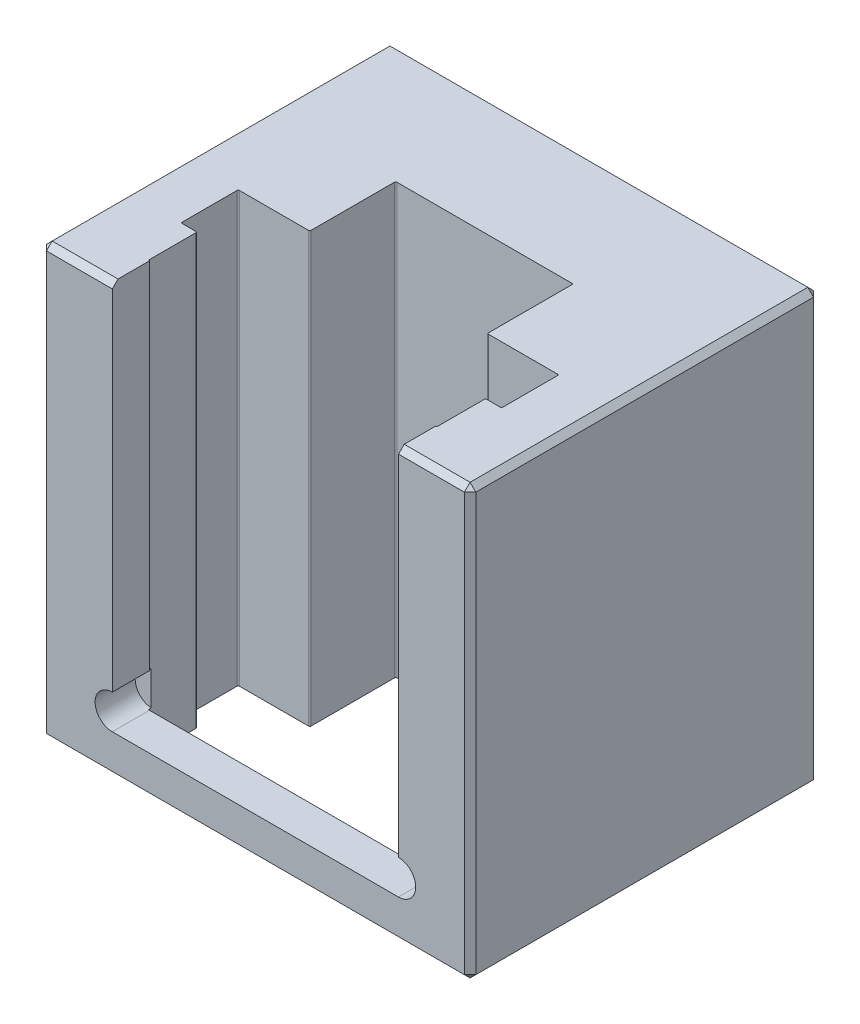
ISO-10303-21;
HEADER;
FILE_DESCRIPTION(('STEP AP214'),'2;1');
FILE_NAME('part.step','',(''),(''),'','','');
FILE_SCHEMA(('AUTOMOTIVE_DESIGN { 1 0 10303 214 1 1 1 1 }'));
ENDSEC;
DATA;
#1=APPLICATION_CONTEXT('core data for automotive mechanical design processes');
#2=APPLICATION_PROTOCOL_DEFINITION('international standard','automotive_design',2000,#1);
#3=PRODUCT_CONTEXT('',#1,'mechanical');
#4=PRODUCT('Part','Part','',(#3));
#5=PRODUCT_RELATED_PRODUCT_CATEGORY('part','',(#4));
#6=PRODUCT_DEFINITION_FORMATION('','',#4);
#7=PRODUCT_DEFINITION_CONTEXT('part definition',#1,'design');
#8=PRODUCT_DEFINITION('design','',#6,#7);
#9=PRODUCT_DEFINITION_SHAPE('','',#8);
#10=(LENGTH_UNIT() NAMED_UNIT(*) SI_UNIT(.MILLI.,.METRE.));
#11=(NAMED_UNIT(*) PLANE_ANGLE_UNIT() SI_UNIT($,.RADIAN.));
#12=(NAMED_UNIT(*) SI_UNIT($,.STERADIAN.) SOLID_ANGLE_UNIT());
#13=UNCERTAINTY_MEASURE_WITH_UNIT(LENGTH_MEASURE(1.E-05),#10,'distance_accuracy_value','');
#14=(GEOMETRIC_REPRESENTATION_CONTEXT(3) GLOBAL_UNCERTAINTY_ASSIGNED_CONTEXT((#13)) GLOBAL_UNIT_ASSIGNED_CONTEXT((#10,
#11,#12)) REPRESENTATION_CONTEXT('',''));
#15=CARTESIAN_POINT('',(0.,0.,0.));
#16=DIRECTION('',(0.,0.,1.));
#17=DIRECTION('',(1.,0.,0.));
#18=AXIS2_PLACEMENT_3D('',#15,#16,#17);
#19=CARTESIAN_POINT('',(0.,0.,61.));
#20=DIRECTION('',(0.,0.,-1.));
#21=DIRECTION('',(-1.,0.,0.));
#22=AXIS2_PLACEMENT_3D('',#19,#20,#21);
#23=CYLINDRICAL_SURFACE('',#22,5.);
#24=CARTESIAN_POINT('',(0.,0.,15.3));
#25=DIRECTION('',(0.,0.,1.));
#26=DIRECTION('',(1.,0.,0.));
#27=AXIS2_PLACEMENT_3D('',#24,#25,#26);
#28=CIRCLE('',#27,5.);
#29=CARTESIAN_POINT('',(-5.,0.,15.3));
#30=VERTEX_POINT('',#29);
#31=EDGE_CURVE('E12',#30,#30,#28,.T.);
#32=CARTESIAN_POINT('',(0.,0.,0.));
#33=DIRECTION('',(0.,0.,-1.));
#34=DIRECTION('',(-1.,0.,0.));
#35=AXIS2_PLACEMENT_3D('',#32,#33,#34);
#36=CIRCLE('',#35,5.);
#37=CARTESIAN_POINT('',(-5.,0.,0.));
#38=VERTEX_POINT('',#37);
#39=EDGE_CURVE('E390',#38,#38,#36,.T.);
#40=CARTESIAN_POINT('',(-5.,0.,15.3));
#41=CARTESIAN_POINT('',(-5.,0.,15.140625));
#42=CARTESIAN_POINT('',(-5.,0.,14.98125));
#43=CARTESIAN_POINT('',(-5.,0.,14.6625));
#44=CARTESIAN_POINT('',(-5.,0.,14.503125));
#45=CARTESIAN_POINT('',(-5.,0.,14.184375));
#46=CARTESIAN_POINT('',(-5.,0.,14.025));
#47=CARTESIAN_POINT('',(-5.,0.,13.70625));
#48=CARTESIAN_POINT('',(-5.,0.,13.546875));
#49=CARTESIAN_POINT('',(-5.,0.,13.228125));
#50=CARTESIAN_POINT('',(-5.,0.,13.06875));
#51=CARTESIAN_POINT('',(-5.,0.,12.75));
#52=CARTESIAN_POINT('',(-5.,0.,12.590625));
#53=CARTESIAN_POINT('',(-5.,0.,12.271875));
#54=CARTESIAN_POINT('',(-5.,0.,12.1125));
#55=CARTESIAN_POINT('',(-5.,0.,11.79375));
#56=CARTESIAN_POINT('',(-5.,0.,11.634375));
#57=CARTESIAN_POINT('',(-5.,0.,11.315625));
#58=CARTESIAN_POINT('',(-5.,0.,11.15625));
#59=CARTESIAN_POINT('',(-5.,0.,10.8375));
#60=CARTESIAN_POINT('',(-5.,0.,10.678125));
#61=CARTESIAN_POINT('',(-5.,0.,10.359375));
#62=CARTESIAN_POINT('',(-5.,0.,10.2));
#63=CARTESIAN_POINT('',(-5.,0.,9.88125000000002));
#64=CARTESIAN_POINT('',(-5.,0.,9.72187500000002));
#65=CARTESIAN_POINT('',(-5.,0.,9.40312500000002));
#66=CARTESIAN_POINT('',(-5.,0.,9.24375000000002));
#67=CARTESIAN_POINT('',(-5.,0.,8.92500000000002));
#68=CARTESIAN_POINT('',(-5.,0.,8.76562500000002));
#69=CARTESIAN_POINT('',(-5.,0.,8.44687500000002));
#70=CARTESIAN_POINT('',(-5.,0.,8.28750000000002));
#71=CARTESIAN_POINT('',(-5.,0.,7.96875000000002));
#72=CARTESIAN_POINT('',(-5.,0.,7.80937500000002));
#73=CARTESIAN_POINT('',(-5.,0.,7.49062500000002));
#74=CARTESIAN_POINT('',(-5.,0.,7.33125000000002));
#75=CARTESIAN_POINT('',(-5.,0.,7.01250000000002));
#76=CARTESIAN_POINT('',(-5.,0.,6.85312500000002));
#77=CARTESIAN_POINT('',(-5.,0.,6.53437500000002));
#78=CARTESIAN_POINT('',(-5.,0.,6.37500000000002));
#79=CARTESIAN_POINT('',(-5.,0.,6.05625000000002));
#80=CARTESIAN_POINT('',(-5.,0.,5.89687500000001));
#81=CARTESIAN_POINT('',(-5.,0.,5.57812500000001));
#82=CARTESIAN_POINT('',(-5.,0.,5.41875000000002));
#83=CARTESIAN_POINT('',(-5.,0.,5.10000000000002));
#84=CARTESIAN_POINT('',(-5.,0.,4.94062500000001));
#85=CARTESIAN_POINT('',(-5.,0.,4.62187500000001));
#86=CARTESIAN_POINT('',(-5.,0.,4.46250000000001));
#87=CARTESIAN_POINT('',(-5.,0.,4.14375000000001));
#88=CARTESIAN_POINT('',(-5.,0.,3.98437500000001));
#89=CARTESIAN_POINT('',(-5.,0.,3.66562500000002));
#90=CARTESIAN_POINT('',(-5.,0.,3.50625000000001));
#91=CARTESIAN_POINT('',(-5.,0.,3.18750000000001));
#92=CARTESIAN_POINT('',(-5.,0.,3.02812500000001));
#93=CARTESIAN_POINT('',(-5.,0.,2.70937500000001));
#94=CARTESIAN_POINT('',(-5.,0.,2.55000000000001));
#95=CARTESIAN_POINT('',(-5.,0.,2.23125000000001));
#96=CARTESIAN_POINT('',(-5.,0.,2.07187500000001));
#97=CARTESIAN_POINT('',(-5.,0.,1.75312500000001));
#98=CARTESIAN_POINT('',(-5.,0.,1.59375000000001));
#99=CARTESIAN_POINT('',(-5.,0.,1.27500000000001));
#100=CARTESIAN_POINT('',(-5.,0.,1.11562500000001));
#101=CARTESIAN_POINT('',(-5.,0.,0.796875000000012));
#102=CARTESIAN_POINT('',(-5.,0.,0.637500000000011));
#103=CARTESIAN_POINT('',(-5.,0.,0.318750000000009));
#104=CARTESIAN_POINT('',(-5.,0.,0.159375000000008));
#105=CARTESIAN_POINT('',(-5.,0.,0.));
#106=B_SPLINE_CURVE_WITH_KNOTS('',3,(#40,#41,#42,#43,#44,#45,#46,#47,#48,#49,#50,#51,#52,#53,
#54,#55,#56,#57,#58,#59,#60,#61,#62,#63,#64,#65,#66,#67,#68,#69,#70,#71,#72,#73,#74,#75,#76,#77,
#78,#79,#80,#81,#82,#83,#84,#85,#86,#87,#88,#89,#90,#91,#92,#93,#94,#95,#96,#97,#98,#99,#100,
#101,#102,#103,#104,#105),.UNSPECIFIED.,.F.,.F.,(4,2,2,2,2,2,2,2,2,2,2,2,2,2,2,2,2,2,2,2,2,2,2,
2,2,2,2,2,2,2,2,2,4),(0.,0.478125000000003,0.956249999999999,1.434375,1.9125,2.390625,2.86875,
3.34687500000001,3.82500000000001,4.303125,4.78125000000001,5.25937500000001,5.73750000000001,
6.21562500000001,6.69375000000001,7.17187500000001,7.65000000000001,8.12812500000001,
8.60625000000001,9.08437500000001,9.56250000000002,10.040625,10.51875,10.996875,11.475,
11.953125,12.43125,12.909375,13.3875,13.865625,14.34375,14.821875,15.3),.UNSPECIFIED.);
#107=EDGE_CURVE('BSEAM37',#30,#38,#106,.T.);
#108=ORIENTED_EDGE('',*,*,#31,.T.);
#109=ORIENTED_EDGE('',*,*,#39,.T.);
#110=ORIENTED_EDGE('',*,*,#107,.T.);
#111=ORIENTED_EDGE('',*,*,#107,.F.);
#112=EDGE_LOOP('',(#108,#110,#109,#111));
#113=FACE_BOUND('',#112,.T.);
#114=ADVANCED_FACE('F37',(#113),#23,.F.);
#115=CARTESIAN_POINT('',(25.,-37.5,54.3));
#116=DIRECTION('',(0.,-1.,0.));
#117=DIRECTION('',(1.,0.,0.));
#118=AXIS2_PLACEMENT_3D('',#115,#116,#117);
#119=CYLINDRICAL_SURFACE('',#118,0.2);
#120=DIRECTION('',(0.,1.,0.));
#121=VECTOR('',#120,1.);
#122=CARTESIAN_POINT('',(25.2,37.5,54.3));
#123=LINE('',#122,#121);
#124=CARTESIAN_POINT('',(25.2,-24.5066740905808,54.3));
#125=VERTEX_POINT('',#124);
#126=CARTESIAN_POINT('',(25.2,37.5,54.3));
#127=VERTEX_POINT('',#126);
#128=EDGE_CURVE('E643',#125,#127,#123,.T.);
#129=ORIENTED_EDGE('',*,*,#128,.F.);
#130=CARTESIAN_POINT('',(25.2,-24.5066740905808,54.3));
#131=CARTESIAN_POINT('',(25.1999995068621,-24.5066740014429,54.3112206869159));
#132=CARTESIAN_POINT('',(25.1990525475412,-24.5066103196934,54.322449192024));
#133=CARTESIAN_POINT('',(25.1952885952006,-24.5063624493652,54.3445960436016));
#134=CARTESIAN_POINT('',(25.192469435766,-24.5061781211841,54.355514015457));
#135=CARTESIAN_POINT('',(25.1850425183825,-24.505709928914,54.376715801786));
#136=CARTESIAN_POINT('',(25.1804357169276,-24.505426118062,54.3869999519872));
#137=CARTESIAN_POINT('',(25.1695658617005,-24.5047910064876,54.4066463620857));
#138=CARTESIAN_POINT('',(25.1633031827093,-24.5044397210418,54.4160088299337));
#139=CARTESIAN_POINT('',(25.1492877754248,-24.5037085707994,54.4335645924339));
#140=CARTESIAN_POINT('',(25.1415328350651,-24.5033286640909,54.4417561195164));
#141=CARTESIAN_POINT('',(25.1247576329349,-24.5025834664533,54.4567223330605));
#142=CARTESIAN_POINT('',(25.1157373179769,-24.5022181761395,54.4634969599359));
#143=CARTESIAN_POINT('',(25.0966773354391,-24.5015430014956,54.4754425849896));
#144=CARTESIAN_POINT('',(25.0866367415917,-24.5012331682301,54.4806121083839));
#145=CARTESIAN_POINT('',(25.0658277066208,-24.5007042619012,54.4891913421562));
#146=CARTESIAN_POINT('',(25.0550592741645,-24.5004851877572,54.4926010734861));
#147=CARTESIAN_POINT('',(25.033117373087,-24.5001627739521,54.4975589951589));
#148=CARTESIAN_POINT('',(25.0219445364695,-24.5000592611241,54.4991099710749));
#149=CARTESIAN_POINT('',(24.9994966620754,-24.4999790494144,54.5003149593));
#150=CARTESIAN_POINT('',(24.9882216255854,-24.5000023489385,54.4999689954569));
#151=CARTESIAN_POINT('',(24.9659082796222,-24.5001729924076,54.4973922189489));
#152=CARTESIAN_POINT('',(24.9548696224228,-24.5003201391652,54.4951644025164));
#153=CARTESIAN_POINT('',(24.9333232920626,-24.5007216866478,54.4888918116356));
#154=CARTESIAN_POINT('',(24.9228156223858,-24.5009760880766,54.4848470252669));
#155=CARTESIAN_POINT('',(24.9026199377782,-24.5015638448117,54.475051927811));
#156=CARTESIAN_POINT('',(24.8929325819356,-24.5018972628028,54.4693002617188));
#157=CARTESIAN_POINT('',(24.8746597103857,-24.502605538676,54.4562556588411));
#158=CARTESIAN_POINT('',(24.8660742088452,-24.5029803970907,54.4489627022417));
#159=CARTESIAN_POINT('',(24.8502312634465,-24.5037302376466,54.4330256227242));
#160=CARTESIAN_POINT('',(24.8429764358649,-24.5041052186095,54.4243788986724));
#161=CARTESIAN_POINT('',(24.830020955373,-24.5048123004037,54.405988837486));
#162=CARTESIAN_POINT('',(24.8243203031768,-24.5051444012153,54.3962454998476));
#163=CARTESIAN_POINT('',(24.8146351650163,-24.5057282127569,54.3759370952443));
#164=CARTESIAN_POINT('',(24.8106507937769,-24.5059799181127,54.3653719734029));
#165=CARTESIAN_POINT('',(24.8045131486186,-24.5063743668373,54.3437206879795));
#166=CARTESIAN_POINT('',(24.8023598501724,-24.5065171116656,54.3326345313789));
#167=CARTESIAN_POINT('',(24.7999487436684,-24.5066772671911,54.3102787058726));
#168=CARTESIAN_POINT('',(24.799687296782,-24.5066949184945,54.2990094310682));
#169=CARTESIAN_POINT('',(24.8010578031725,-24.5066035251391,54.2765871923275));
#170=CARTESIAN_POINT('',(24.8026897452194,-24.5064944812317,54.2654342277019));
#171=CARTESIAN_POINT('',(24.8077976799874,-24.5061622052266,54.2435715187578));
#172=CARTESIAN_POINT('',(24.8112719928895,-24.505939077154,54.2328613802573));
#173=CARTESIAN_POINT('',(24.8199643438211,-24.5054038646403,54.2121761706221));
#174=CARTESIAN_POINT('',(24.825182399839,-24.5050917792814,54.2022011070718));
#175=CARTESIAN_POINT('',(24.8372233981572,-24.5044132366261,54.1832524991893));
#176=CARTESIAN_POINT('',(24.8440487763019,-24.5040466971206,54.1742805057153));
#177=CARTESIAN_POINT('',(24.8591071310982,-24.5033008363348,54.1576083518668));
#178=CARTESIAN_POINT('',(24.8673401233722,-24.5029215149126,54.1499082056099));
#179=CARTESIAN_POINT('',(24.8849956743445,-24.502192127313,54.1359860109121));
#180=CARTESIAN_POINT('',(24.8944200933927,-24.5018421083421,54.1297663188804));
#181=CARTESIAN_POINT('',(24.9141816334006,-24.5012114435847,54.1189977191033));
#182=CARTESIAN_POINT('',(24.9245187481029,-24.5009307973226,54.1144487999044));
#183=CARTESIAN_POINT('',(24.9458036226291,-24.5004707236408,54.1071549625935));
#184=CARTESIAN_POINT('',(24.9567508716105,-24.5002912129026,54.1044085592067));
#185=CARTESIAN_POINT('',(24.9789523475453,-24.5000533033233,54.1007928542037));
#186=CARTESIAN_POINT('',(24.9902065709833,-24.4999949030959,54.0999235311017));
#187=CARTESIAN_POINT('',(25.0126792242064,-24.5000057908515,54.1000868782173));
#188=CARTESIAN_POINT('',(25.0238976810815,-24.5000748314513,54.1011158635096));
#189=CARTESIAN_POINT('',(25.0460021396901,-24.5003323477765,54.1050389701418));
#190=CARTESIAN_POINT('',(25.0568881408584,-24.5005208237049,54.1079330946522));
#191=CARTESIAN_POINT('',(25.0780191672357,-24.5009960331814,54.1155034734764));
#192=CARTESIAN_POINT('',(25.0882642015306,-24.5012827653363,54.1201797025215));
#193=CARTESIAN_POINT('',(25.1078242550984,-24.501922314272,54.1311810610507));
#194=CARTESIAN_POINT('',(25.1171392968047,-24.5022751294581,54.1375061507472));
#195=CARTESIAN_POINT('',(25.1345936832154,-24.503007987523,54.1516393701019));
#196=CARTESIAN_POINT('',(25.1427308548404,-24.5033880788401,54.1594501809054));
#197=CARTESIAN_POINT('',(25.1575814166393,-24.5041322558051,54.1763291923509));
#198=CARTESIAN_POINT('',(25.1642944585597,-24.5044963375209,54.1853976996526));
#199=CARTESIAN_POINT('',(25.1761118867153,-24.5051678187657,54.2045463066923));
#200=CARTESIAN_POINT('',(25.1812140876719,-24.5054751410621,54.2146277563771));
#201=CARTESIAN_POINT('',(25.189647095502,-24.505997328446,54.235499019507));
#202=CARTESIAN_POINT('',(25.1929799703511,-24.5062123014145,54.2462879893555));
#203=CARTESIAN_POINT('',(25.1969165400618,-24.506469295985,54.2642854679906));
#204=CARTESIAN_POINT('',(25.1980713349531,-24.5065457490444,54.2713777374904));
#205=CARTESIAN_POINT('',(25.1996132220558,-24.5066481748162,54.285645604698));
#206=CARTESIAN_POINT('',(25.200000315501,-24.5066741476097,54.292821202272));
#207=CARTESIAN_POINT('',(25.2,-24.5066740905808,54.3));
#208=B_SPLINE_CURVE_WITH_KNOTS('',3,(#130,#131,#132,#133,#134,#135,#136,#137,#138,#139,#140,
#141,#142,#143,#144,#145,#146,#147,#148,#149,#150,#151,#152,#153,#154,#155,#156,#157,#158,#159,
#160,#161,#162,#163,#164,#165,#166,#167,#168,#169,#170,#171,#172,#173,#174,#175,#176,#177,#178,
#179,#180,#181,#182,#183,#184,#185,#186,#187,#188,#189,#190,#191,#192,#193,#194,#195,#196,#197,
#198,#199,#200,#201,#202,#203,#204,#205,#206,#207),.UNSPECIFIED.,.T.,.F.,(4,2,2,2,2,2,2,2,2,2,2,
2,2,2,2,2,2,2,2,2,2,2,2,2,2,2,2,2,2,2,2,2,2,2,2,2,2,2,4),(0.,0.0336358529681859,
0.0673106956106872,0.100967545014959,0.134616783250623,0.168316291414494,0.202017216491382,
0.23574901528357,0.269480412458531,0.303161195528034,0.336841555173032,0.370468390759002,
0.404095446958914,0.437749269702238,0.471403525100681,0.505123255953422,0.538843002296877,
0.572565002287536,0.606286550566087,0.639943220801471,0.673599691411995,0.707225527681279,
0.74085171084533,0.774529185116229,0.80820703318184,0.841938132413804,0.875669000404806,
0.909372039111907,0.943074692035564,0.97671199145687,1.01034934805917,1.0439862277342,
1.07762229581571,1.11131964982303,1.14502523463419,1.17877635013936,1.21248793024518,
1.23400759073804,1.25552721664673),.UNSPECIFIED.);
#209=CARTESIAN_POINT('',(24.9999999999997,-24.4999999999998,54.5000000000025));
#210=VERTEX_POINT('',#209);
#211=EDGE_CURVE('E950',#125,#210,#208,.T.);
#212=ORIENTED_EDGE('',*,*,#211,.T.);
#213=DIRECTION('',(0.,-1.,0.));
#214=VECTOR('',#213,1.);
#215=CARTESIAN_POINT('',(25.,37.5,54.5));
#216=LINE('',#215,#214);
#217=CARTESIAN_POINT('',(25.,37.5,54.5));
#218=VERTEX_POINT('',#217);
#219=EDGE_CURVE('E420',#218,#210,#216,.T.);
#220=ORIENTED_EDGE('',*,*,#219,.F.);
#221=CARTESIAN_POINT('',(25.,37.5,54.3));
#222=DIRECTION('',(0.,-1.,0.));
#223=DIRECTION('',(1.,0.,0.));
#224=AXIS2_PLACEMENT_3D('',#221,#222,#223);
#225=CIRCLE('',#224,0.2);
#226=EDGE_CURVE('E719',#127,#218,#225,.T.);
#227=ORIENTED_EDGE('',*,*,#226,.F.);
#228=EDGE_LOOP('',(#129,#212,#220,#227));
#229=FACE_BOUND('',#228,.T.);
#230=ADVANCED_FACE('F943',(#229),#119,.F.);
#231=CARTESIAN_POINT('',(-25.,-37.5,54.3));
#232=DIRECTION('',(0.,-1.,0.));
#233=DIRECTION('',(1.,0.,0.));
#234=AXIS2_PLACEMENT_3D('',#231,#232,#233);
#235=CYLINDRICAL_SURFACE('',#234,0.2);
#236=DIRECTION('',(0.,1.,0.));
#237=VECTOR('',#236,1.);
#238=CARTESIAN_POINT('',(-25.,37.5,54.5));
#239=LINE('',#238,#237);
#240=CARTESIAN_POINT('',(-25.0000000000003,-24.4999999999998,54.5000000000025));
#241=VERTEX_POINT('',#240);
#242=CARTESIAN_POINT('',(-25.,37.5,54.5));
#243=VERTEX_POINT('',#242);
#244=EDGE_CURVE('E423',#241,#243,#239,.T.);
#245=ORIENTED_EDGE('',*,*,#244,.F.);
#246=CARTESIAN_POINT('',(-24.8,-24.5066740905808,54.3));
#247=CARTESIAN_POINT('',(-24.8000004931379,-24.5066740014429,54.3112206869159));
#248=CARTESIAN_POINT('',(-24.8009474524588,-24.5066103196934,54.322449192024));
#249=CARTESIAN_POINT('',(-24.8047114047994,-24.5063624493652,54.3445960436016));
#250=CARTESIAN_POINT('',(-24.807530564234,-24.5061781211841,54.355514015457));
#251=CARTESIAN_POINT('',(-24.8149574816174,-24.505709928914,54.376715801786));
#252=CARTESIAN_POINT('',(-24.8195642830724,-24.505426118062,54.3869999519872));
#253=CARTESIAN_POINT('',(-24.8304341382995,-24.5047910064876,54.4066463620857));
#254=CARTESIAN_POINT('',(-24.8366968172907,-24.5044397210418,54.4160088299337));
#255=CARTESIAN_POINT('',(-24.8507122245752,-24.5037085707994,54.4335645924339));
#256=CARTESIAN_POINT('',(-24.8584671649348,-24.5033286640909,54.4417561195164));
#257=CARTESIAN_POINT('',(-24.8752423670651,-24.5025834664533,54.4567223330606));
#258=CARTESIAN_POINT('',(-24.8842626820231,-24.5022181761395,54.4634969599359));
#259=CARTESIAN_POINT('',(-24.9033226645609,-24.5015430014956,54.4754425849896));
#260=CARTESIAN_POINT('',(-24.9133632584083,-24.5012331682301,54.4806121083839));
#261=CARTESIAN_POINT('',(-24.9341722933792,-24.5007042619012,54.4891913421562));
#262=CARTESIAN_POINT('',(-24.9449407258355,-24.5004851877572,54.4926010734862));
#263=CARTESIAN_POINT('',(-24.966882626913,-24.5001627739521,54.4975589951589));
#264=CARTESIAN_POINT('',(-24.9780554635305,-24.5000592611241,54.4991099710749));
#265=CARTESIAN_POINT('',(-25.0005033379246,-24.4999790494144,54.5003149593));
#266=CARTESIAN_POINT('',(-25.0117783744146,-24.5000023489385,54.4999689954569));
#267=CARTESIAN_POINT('',(-25.0340917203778,-24.5001729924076,54.4973922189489));
#268=CARTESIAN_POINT('',(-25.0451303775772,-24.5003201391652,54.4951644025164));
#269=CARTESIAN_POINT('',(-25.0666767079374,-24.5007216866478,54.4888918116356));
#270=CARTESIAN_POINT('',(-25.0771843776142,-24.5009760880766,54.4848470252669));
#271=CARTESIAN_POINT('',(-25.0973800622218,-24.5015638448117,54.475051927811));
#272=CARTESIAN_POINT('',(-25.1070674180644,-24.5018972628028,54.4693002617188));
#273=CARTESIAN_POINT('',(-25.1253402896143,-24.502605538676,54.4562556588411));
#274=CARTESIAN_POINT('',(-25.1339257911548,-24.5029803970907,54.4489627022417));
#275=CARTESIAN_POINT('',(-25.1497687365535,-24.5037302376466,54.4330256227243));
#276=CARTESIAN_POINT('',(-25.1570235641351,-24.5041052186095,54.4243788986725));
#277=CARTESIAN_POINT('',(-25.169979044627,-24.5048123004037,54.405988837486));
#278=CARTESIAN_POINT('',(-25.1756796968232,-24.5051444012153,54.3962454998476));
#279=CARTESIAN_POINT('',(-25.1853648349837,-24.5057282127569,54.3759370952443));
#280=CARTESIAN_POINT('',(-25.1893492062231,-24.5059799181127,54.3653719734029));
#281=CARTESIAN_POINT('',(-25.1954868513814,-24.5063743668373,54.3437206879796));
#282=CARTESIAN_POINT('',(-25.1976401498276,-24.5065171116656,54.332634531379));
#283=CARTESIAN_POINT('',(-25.2000512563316,-24.5066772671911,54.3102787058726));
#284=CARTESIAN_POINT('',(-25.200312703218,-24.5066949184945,54.2990094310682));
#285=CARTESIAN_POINT('',(-25.1989421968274,-24.5066035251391,54.2765871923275));
#286=CARTESIAN_POINT('',(-25.1973102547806,-24.5064944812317,54.2654342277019));
#287=CARTESIAN_POINT('',(-25.1922023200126,-24.5061622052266,54.2435715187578));
#288=CARTESIAN_POINT('',(-25.1887280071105,-24.505939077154,54.2328613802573));
#289=CARTESIAN_POINT('',(-25.1800356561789,-24.5054038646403,54.2121761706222));
#290=CARTESIAN_POINT('',(-25.174817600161,-24.5050917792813,54.2022011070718));
#291=CARTESIAN_POINT('',(-25.1627766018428,-24.5044132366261,54.1832524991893));
#292=CARTESIAN_POINT('',(-25.1559512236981,-24.5040466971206,54.1742805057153));
#293=CARTESIAN_POINT('',(-25.1408928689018,-24.5033008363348,54.1576083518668));
#294=CARTESIAN_POINT('',(-25.1326598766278,-24.5029215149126,54.1499082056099));
#295=CARTESIAN_POINT('',(-25.1150043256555,-24.502192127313,54.1359860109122));
#296=CARTESIAN_POINT('',(-25.1055799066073,-24.5018421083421,54.1297663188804));
#297=CARTESIAN_POINT('',(-25.0858183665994,-24.5012114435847,54.1189977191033));
#298=CARTESIAN_POINT('',(-25.0754812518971,-24.5009307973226,54.1144487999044));
#299=CARTESIAN_POINT('',(-25.0541963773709,-24.5004707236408,54.1071549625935));
#300=CARTESIAN_POINT('',(-25.0432491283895,-24.5002912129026,54.1044085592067));
#301=CARTESIAN_POINT('',(-25.0210476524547,-24.5000533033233,54.1007928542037));
#302=CARTESIAN_POINT('',(-25.0097934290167,-24.4999949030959,54.0999235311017));
#303=CARTESIAN_POINT('',(-24.9873207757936,-24.5000057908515,54.1000868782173));
#304=CARTESIAN_POINT('',(-24.9761023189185,-24.5000748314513,54.1011158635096));
#305=CARTESIAN_POINT('',(-24.9539978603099,-24.5003323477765,54.1050389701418));
#306=CARTESIAN_POINT('',(-24.9431118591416,-24.5005208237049,54.1079330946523));
#307=CARTESIAN_POINT('',(-24.9219808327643,-24.5009960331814,54.1155034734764));
#308=CARTESIAN_POINT('',(-24.9117357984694,-24.5012827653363,54.1201797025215));
#309=CARTESIAN_POINT('',(-24.8921757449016,-24.501922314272,54.1311810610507));
#310=CARTESIAN_POINT('',(-24.8828607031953,-24.5022751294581,54.1375061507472));
#311=CARTESIAN_POINT('',(-24.8654063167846,-24.503007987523,54.1516393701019));
#312=CARTESIAN_POINT('',(-24.8572691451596,-24.5033880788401,54.1594501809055));
#313=CARTESIAN_POINT('',(-24.8424185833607,-24.5041322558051,54.1763291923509));
#314=CARTESIAN_POINT('',(-24.8357055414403,-24.5044963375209,54.1853976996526));
#315=CARTESIAN_POINT('',(-24.8238881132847,-24.5051678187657,54.2045463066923));
#316=CARTESIAN_POINT('',(-24.8187859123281,-24.5054751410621,54.2146277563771));
#317=CARTESIAN_POINT('',(-24.810352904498,-24.505997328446,54.235499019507));
#318=CARTESIAN_POINT('',(-24.8070200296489,-24.5062123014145,54.2462879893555));
#319=CARTESIAN_POINT('',(-24.8030834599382,-24.506469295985,54.2642854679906));
#320=CARTESIAN_POINT('',(-24.8019286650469,-24.5065457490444,54.2713777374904));
#321=CARTESIAN_POINT('',(-24.8003867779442,-24.5066481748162,54.285645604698));
#322=CARTESIAN_POINT('',(-24.799999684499,-24.5066741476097,54.292821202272));
#323=CARTESIAN_POINT('',(-24.8,-24.5066740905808,54.3));
#324=B_SPLINE_CURVE_WITH_KNOTS('',3,(#246,#247,#248,#249,#250,#251,#252,#253,#254,#255,#256,
#257,#258,#259,#260,#261,#262,#263,#264,#265,#266,#267,#268,#269,#270,#271,#272,#273,#274,#275,
#276,#277,#278,#279,#280,#281,#282,#283,#284,#285,#286,#287,#288,#289,#290,#291,#292,#293,#294,
#295,#296,#297,#298,#299,#300,#301,#302,#303,#304,#305,#306,#307,#308,#309,#310,#311,#312,#313,
#314,#315,#316,#317,#318,#319,#320,#321,#322,#323),.UNSPECIFIED.,.T.,.F.,(4,2,2,2,2,2,2,2,2,2,2,
2,2,2,2,2,2,2,2,2,2,2,2,2,2,2,2,2,2,2,2,2,2,2,2,2,2,2,4),(0.,0.0336358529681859,
0.0673106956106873,0.100967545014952,0.134616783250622,0.168316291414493,0.202017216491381,
0.235749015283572,0.26948041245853,0.30316119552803,0.336841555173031,0.370468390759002,
0.404095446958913,0.437749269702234,0.47140352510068,0.505123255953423,0.538843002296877,
0.572565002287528,0.606286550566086,0.639943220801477,0.673599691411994,0.707225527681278,
0.740851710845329,0.774529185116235,0.808207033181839,0.84193813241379,0.875669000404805,
0.909372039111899,0.943074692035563,0.976711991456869,1.01034934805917,1.04398622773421,
1.07762229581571,1.11131964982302,1.14502523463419,1.17877635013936,1.21248793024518,
1.23400759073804,1.25552721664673),.UNSPECIFIED.);
#325=CARTESIAN_POINT('',(-25.2000000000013,-24.5066740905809,54.3000000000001));
#326=VERTEX_POINT('',#325);
#327=EDGE_CURVE('E758',#241,#326,#324,.T.);
#328=ORIENTED_EDGE('',*,*,#327,.T.);
#329=DIRECTION('',(0.,1.,0.));
#330=VECTOR('',#329,1.);
#331=CARTESIAN_POINT('',(-25.2,-37.5,54.3));
#332=LINE('',#331,#330);
#333=CARTESIAN_POINT('',(-25.2,37.5,54.3));
#334=VERTEX_POINT('',#333);
#335=EDGE_CURVE('E656',#334,#326,#332,.F.);
#336=ORIENTED_EDGE('',*,*,#335,.F.);
#337=CARTESIAN_POINT('',(-25.,37.5,54.3));
#338=DIRECTION('',(0.,-1.,0.));
#339=DIRECTION('',(1.,0.,0.));
#340=AXIS2_PLACEMENT_3D('',#337,#338,#339);
#341=CIRCLE('',#340,0.2);
#342=EDGE_CURVE('E723',#243,#334,#341,.T.);
#343=ORIENTED_EDGE('',*,*,#342,.F.);
#344=EDGE_LOOP('',(#245,#328,#336,#343));
#345=FACE_BOUND('',#344,.T.);
#346=ADVANCED_FACE('F1180',(#345),#235,.F.);
#347=CARTESIAN_POINT('',(0.,36.5,61.));
#348=DIRECTION('',(0.,0.707106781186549,0.707106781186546));
#349=DIRECTION('',(1.,0.,0.));
#350=AXIS2_PLACEMENT_3D('',#347,#348,#349);
#351=PLANE('',#350);
#352=DIRECTION('',(0.,-0.707106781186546,0.707106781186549));
#353=VECTOR('',#352,1.);
#354=CARTESIAN_POINT('',(-25.,36.5,61.));
#355=LINE('',#354,#353);
#356=CARTESIAN_POINT('',(-25.,37.5,60.));
#357=VERTEX_POINT('',#356);
#358=CARTESIAN_POINT('',(-25.,36.5,61.));
#359=VERTEX_POINT('',#358);
#360=EDGE_CURVE('E447',#357,#359,#355,.T.);
#361=ORIENTED_EDGE('',*,*,#360,.F.);
#362=DIRECTION('',(1.,0.,0.));
#363=VECTOR('',#362,1.);
#364=CARTESIAN_POINT('',(37.5,37.5,60.));
#365=LINE('',#364,#363);
#366=CARTESIAN_POINT('',(-36.5,37.5,60.));
#367=VERTEX_POINT('',#366);
#368=EDGE_CURVE('E535',#367,#357,#365,.T.);
#369=ORIENTED_EDGE('',*,*,#368,.F.);
#370=DIRECTION('',(0.,0.707106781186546,-0.707106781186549));
#371=VECTOR('',#370,1.);
#372=CARTESIAN_POINT('',(-36.5,36.5,61.));
#373=LINE('',#372,#371);
#374=CARTESIAN_POINT('',(-36.5,36.5,61.));
#375=VERTEX_POINT('',#374);
#376=EDGE_CURVE('E486',#367,#375,#373,.F.);
#377=ORIENTED_EDGE('',*,*,#376,.T.);
#378=DIRECTION('',(-1.,0.,0.));
#379=VECTOR('',#378,1.);
#380=CARTESIAN_POINT('',(-37.5,36.5,61.));
#381=LINE('',#380,#379);
#382=EDGE_CURVE('E524',#359,#375,#381,.T.);
#383=ORIENTED_EDGE('',*,*,#382,.F.);
#384=EDGE_LOOP('',(#361,#369,#377,#383));
#385=FACE_BOUND('',#384,.T.);
#386=ADVANCED_FACE('F861',(#385),#351,.T.);
#387=CARTESIAN_POINT('',(-37.5,37.5,61.));
#388=DIRECTION('',(1.,0.,0.));
#389=DIRECTION('',(0.,1.,0.));
#390=AXIS2_PLACEMENT_3D('',#387,#388,#389);
#391=PLANE('',#390);
#392=DIRECTION('',(0.,0.,1.));
#393=VECTOR('',#392,1.);
#394=CARTESIAN_POINT('',(-37.5,-36.5,61.));
#395=LINE('',#394,#393);
#396=CARTESIAN_POINT('',(-37.5,-36.5,1.00000000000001));
#397=VERTEX_POINT('',#396);
#398=CARTESIAN_POINT('',(-37.5,-36.5,60.));
#399=VERTEX_POINT('',#398);
#400=EDGE_CURVE('E560',#397,#399,#395,.T.);
#401=ORIENTED_EDGE('',*,*,#400,.T.);
#402=DIRECTION('',(0.,1.,0.));
#403=VECTOR('',#402,1.);
#404=CARTESIAN_POINT('',(-37.5,37.5,60.));
#405=LINE('',#404,#403);
#406=CARTESIAN_POINT('',(-37.5,36.5,60.));
#407=VERTEX_POINT('',#406);
#408=EDGE_CURVE('E562',#399,#407,#405,.T.);
#409=ORIENTED_EDGE('',*,*,#408,.T.);
#410=DIRECTION('',(0.,0.,-1.));
#411=VECTOR('',#410,1.);
#412=CARTESIAN_POINT('',(-37.5,36.5,61.));
#413=LINE('',#412,#411);
#414=CARTESIAN_POINT('',(-37.5,36.5,1.00000000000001));
#415=VERTEX_POINT('',#414);
#416=EDGE_CURVE('E556',#407,#415,#413,.T.);
#417=ORIENTED_EDGE('',*,*,#416,.T.);
#418=DIRECTION('',(0.,-1.,0.));
#419=VECTOR('',#418,1.);
#420=CARTESIAN_POINT('',(-37.5,37.5,1.00000000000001));
#421=LINE('',#420,#419);
#422=EDGE_CURVE('E558',#415,#397,#421,.T.);
#423=ORIENTED_EDGE('',*,*,#422,.T.);
#424=EDGE_LOOP('',(#401,#409,#417,#423));
#425=FACE_BOUND('',#424,.T.);
#426=ADVANCED_FACE('F857',(#425),#391,.F.);
#427=CARTESIAN_POINT('',(-37.5,-37.5,61.));
#428=DIRECTION('',(0.,1.,0.));
#429=DIRECTION('',(-1.,0.,0.));
#430=AXIS2_PLACEMENT_3D('',#427,#428,#429);
#431=PLANE('',#430);
#432=DIRECTION('',(0.,0.,-1.));
#433=VECTOR('',#432,1.);
#434=CARTESIAN_POINT('',(25.2,-37.5,46.));
#435=LINE('',#434,#433);
#436=CARTESIAN_POINT('',(25.2,-37.5,54.3));
#437=VERTEX_POINT('',#436);
#438=CARTESIAN_POINT('',(25.2,-37.5,46.2));
#439=VERTEX_POINT('',#438);
#440=EDGE_CURVE('E463',#437,#439,#435,.T.);
#441=ORIENTED_EDGE('',*,*,#440,.T.);
#442=CARTESIAN_POINT('',(25.4,-37.5,46.2));
#443=DIRECTION('',(0.,1.,0.));
#444=DIRECTION('',(-1.,0.,0.));
#445=AXIS2_PLACEMENT_3D('',#442,#443,#444);
#446=CIRCLE('',#445,0.2);
#447=CARTESIAN_POINT('',(25.4,-37.5,46.));
#448=VERTEX_POINT('',#447);
#449=EDGE_CURVE('E678',#439,#448,#446,.F.);
#450=ORIENTED_EDGE('',*,*,#449,.T.);
#451=DIRECTION('',(1.,0.,0.));
#452=VECTOR('',#451,1.);
#453=CARTESIAN_POINT('',(25.2,-37.5,46.));
#454=LINE('',#453,#452);
#455=CARTESIAN_POINT('',(27.8,-37.5,46.));
#456=VERTEX_POINT('',#455);
#457=EDGE_CURVE('E466',#448,#456,#454,.T.);
#458=ORIENTED_EDGE('',*,*,#457,.T.);
#459=CARTESIAN_POINT('',(27.8,-37.5,45.8));
#460=DIRECTION('',(0.,1.,0.));
#461=DIRECTION('',(-1.,0.,0.));
#462=AXIS2_PLACEMENT_3D('',#459,#460,#461);
#463=CIRCLE('',#462,0.2);
#464=CARTESIAN_POINT('',(28.,-37.5,45.8));
#465=VERTEX_POINT('',#464);
#466=EDGE_CURVE('E729',#456,#465,#463,.T.);
#467=ORIENTED_EDGE('',*,*,#466,.T.);
#468=DIRECTION('',(0.,0.,-1.));
#469=VECTOR('',#468,1.);
#470=CARTESIAN_POINT('',(28.,-37.5,46.));
#471=LINE('',#470,#469);
#472=CARTESIAN_POINT('',(28.,-37.5,36.2));
#473=VERTEX_POINT('',#472);
#474=EDGE_CURVE('E469',#465,#473,#471,.T.);
#475=ORIENTED_EDGE('',*,*,#474,.T.);
#476=CARTESIAN_POINT('',(27.8,-37.5,36.2));
#477=DIRECTION('',(0.,1.,0.));
#478=DIRECTION('',(-1.,0.,0.));
#479=AXIS2_PLACEMENT_3D('',#476,#477,#478);
#480=CIRCLE('',#479,0.2);
#481=CARTESIAN_POINT('',(27.8,-37.5,36.));
#482=VERTEX_POINT('',#481);
#483=EDGE_CURVE('E733',#473,#482,#480,.T.);
#484=ORIENTED_EDGE('',*,*,#483,.T.);
#485=DIRECTION('',(-1.,0.,0.));
#486=VECTOR('',#485,1.);
#487=CARTESIAN_POINT('',(15.5,-37.5,36.));
#488=LINE('',#487,#486);
#489=CARTESIAN_POINT('',(15.7,-37.5,36.));
#490=VERTEX_POINT('',#489);
#491=EDGE_CURVE('E472',#482,#490,#488,.T.);
#492=ORIENTED_EDGE('',*,*,#491,.T.);
#493=CARTESIAN_POINT('',(15.7,-37.5,35.8));
#494=DIRECTION('',(0.,1.,0.));
#495=DIRECTION('',(-1.,0.,0.));
#496=AXIS2_PLACEMENT_3D('',#493,#494,#495);
#497=CIRCLE('',#496,0.2);
#498=CARTESIAN_POINT('',(15.5,-37.5,35.8));
#499=VERTEX_POINT('',#498);
#500=EDGE_CURVE('E676',#490,#499,#497,.F.);
#501=ORIENTED_EDGE('',*,*,#500,.T.);
#502=DIRECTION('',(0.,0.,-1.));
#503=VECTOR('',#502,1.);
#504=CARTESIAN_POINT('',(15.5,-37.5,21.));
#505=LINE('',#504,#503);
#506=CARTESIAN_POINT('',(15.5,-37.5,21.2));
#507=VERTEX_POINT('',#506);
#508=EDGE_CURVE('E475',#499,#507,#505,.T.);
#509=ORIENTED_EDGE('',*,*,#508,.T.);
#510=CARTESIAN_POINT('',(15.3,-37.5,21.2));
#511=DIRECTION('',(0.,1.,0.));
#512=DIRECTION('',(-1.,0.,0.));
#513=AXIS2_PLACEMENT_3D('',#510,#511,#512);
#514=CIRCLE('',#513,0.2);
#515=CARTESIAN_POINT('',(15.3,-37.5,21.));
#516=VERTEX_POINT('',#515);
#517=EDGE_CURVE('E737',#507,#516,#514,.T.);
#518=ORIENTED_EDGE('',*,*,#517,.T.);
#519=DIRECTION('',(-1.,0.,0.));
#520=VECTOR('',#519,1.);
#521=CARTESIAN_POINT('',(-15.5,-37.5,21.));
#522=LINE('',#521,#520);
#523=CARTESIAN_POINT('',(-15.3,-37.5,21.));
#524=VERTEX_POINT('',#523);
#525=EDGE_CURVE('E478',#516,#524,#522,.T.);
#526=ORIENTED_EDGE('',*,*,#525,.T.);
#527=CARTESIAN_POINT('',(-15.3,-37.5,21.2));
#528=DIRECTION('',(0.,1.,0.));
#529=DIRECTION('',(-1.,0.,0.));
#530=AXIS2_PLACEMENT_3D('',#527,#528,#529);
#531=CIRCLE('',#530,0.2);
#532=CARTESIAN_POINT('',(-15.5,-37.5,21.2));
#533=VERTEX_POINT('',#532);
#534=EDGE_CURVE('E741',#524,#533,#531,.T.);
#535=ORIENTED_EDGE('',*,*,#534,.T.);
#536=DIRECTION('',(0.,0.,1.));
#537=VECTOR('',#536,1.);
#538=CARTESIAN_POINT('',(-15.5,-37.5,36.));
#539=LINE('',#538,#537);
#540=CARTESIAN_POINT('',(-15.5,-37.5,35.8));
#541=VERTEX_POINT('',#540);
#542=EDGE_CURVE('E481',#533,#541,#539,.T.);
#543=ORIENTED_EDGE('',*,*,#542,.T.);
#544=CARTESIAN_POINT('',(-15.7,-37.5,35.8));
#545=DIRECTION('',(0.,1.,0.));
#546=DIRECTION('',(-1.,0.,0.));
#547=AXIS2_PLACEMENT_3D('',#544,#545,#546);
#548=CIRCLE('',#547,0.2);
#549=CARTESIAN_POINT('',(-15.7,-37.5,36.));
#550=VERTEX_POINT('',#549);
#551=EDGE_CURVE('E674',#541,#550,#548,.F.);
#552=ORIENTED_EDGE('',*,*,#551,.T.);
#553=DIRECTION('',(-1.,0.,0.));
#554=VECTOR('',#553,1.);
#555=CARTESIAN_POINT('',(-28.,-37.5,36.));
#556=LINE('',#555,#554);
#557=CARTESIAN_POINT('',(-27.8,-37.5,36.));
#558=VERTEX_POINT('',#557);
#559=EDGE_CURVE('E483',#550,#558,#556,.T.);
#560=ORIENTED_EDGE('',*,*,#559,.T.);
#561=CARTESIAN_POINT('',(-27.8,-37.5,36.2));
#562=DIRECTION('',(0.,1.,0.));
#563=DIRECTION('',(-1.,0.,0.));
#564=AXIS2_PLACEMENT_3D('',#561,#562,#563);
#565=CIRCLE('',#564,0.2);
#566=CARTESIAN_POINT('',(-28.,-37.5,36.2));
#567=VERTEX_POINT('',#566);
#568=EDGE_CURVE('E745',#558,#567,#565,.T.);
#569=ORIENTED_EDGE('',*,*,#568,.T.);
#570=DIRECTION('',(0.,0.,1.));
#571=VECTOR('',#570,1.);
#572=CARTESIAN_POINT('',(-28.,-37.5,46.));
#573=LINE('',#572,#571);
#574=CARTESIAN_POINT('',(-28.,-37.5,45.8));
#575=VERTEX_POINT('',#574);
#576=EDGE_CURVE('E450',#567,#575,#573,.T.);
#577=ORIENTED_EDGE('',*,*,#576,.T.);
#578=CARTESIAN_POINT('',(-27.8,-37.5,45.8));
#579=DIRECTION('',(0.,1.,0.));
#580=DIRECTION('',(-1.,0.,0.));
#581=AXIS2_PLACEMENT_3D('',#578,#579,#580);
#582=CIRCLE('',#581,0.2);
#583=CARTESIAN_POINT('',(-27.8,-37.5,46.));
#584=VERTEX_POINT('',#583);
#585=EDGE_CURVE('E749',#575,#584,#582,.T.);
#586=ORIENTED_EDGE('',*,*,#585,.T.);
#587=DIRECTION('',(1.,0.,0.));
#588=VECTOR('',#587,1.);
#589=CARTESIAN_POINT('',(-28.,-37.5,46.));
#590=LINE('',#589,#588);
#591=CARTESIAN_POINT('',(-25.4,-37.5,46.));
#592=VERTEX_POINT('',#591);
#593=EDGE_CURVE('E453',#584,#592,#590,.T.);
#594=ORIENTED_EDGE('',*,*,#593,.T.);
#595=CARTESIAN_POINT('',(-25.4,-37.5,46.2));
#596=DIRECTION('',(0.,1.,0.));
#597=DIRECTION('',(-1.,0.,0.));
#598=AXIS2_PLACEMENT_3D('',#595,#596,#597);
#599=CIRCLE('',#598,0.2);
#600=CARTESIAN_POINT('',(-25.2,-37.5,46.2));
#601=VERTEX_POINT('',#600);
#602=EDGE_CURVE('E672',#592,#601,#599,.F.);
#603=ORIENTED_EDGE('',*,*,#602,.T.);
#604=DIRECTION('',(0.,0.,1.));
#605=VECTOR('',#604,1.);
#606=CARTESIAN_POINT('',(-25.2,-37.5,46.));
#607=LINE('',#606,#605);
#608=CARTESIAN_POINT('',(-25.2,-37.5,54.3));
#609=VERTEX_POINT('',#608);
#610=EDGE_CURVE('E457',#601,#609,#607,.T.);
#611=ORIENTED_EDGE('',*,*,#610,.T.);
#612=CARTESIAN_POINT('',(-25.,-37.5,54.3));
#613=DIRECTION('',(0.,1.,0.));
#614=DIRECTION('',(-1.,0.,0.));
#615=AXIS2_PLACEMENT_3D('',#612,#613,#614);
#616=CIRCLE('',#615,0.2);
#617=CARTESIAN_POINT('',(-25.,-37.5,54.5));
#618=VERTEX_POINT('',#617);
#619=EDGE_CURVE('E725',#609,#618,#616,.T.);
#620=ORIENTED_EDGE('',*,*,#619,.T.);
#621=DIRECTION('',(1.,0.,0.));
#622=VECTOR('',#621,1.);
#623=CARTESIAN_POINT('',(-25.2,-37.5,54.5));
#624=LINE('',#623,#622);
#625=CARTESIAN_POINT('',(25.,-37.5,54.5));
#626=VERTEX_POINT('',#625);
#627=EDGE_CURVE('E460',#618,#626,#624,.T.);
#628=ORIENTED_EDGE('',*,*,#627,.T.);
#629=CARTESIAN_POINT('',(25.,-37.5,54.3));
#630=DIRECTION('',(0.,1.,0.));
#631=DIRECTION('',(-1.,0.,0.));
#632=AXIS2_PLACEMENT_3D('',#629,#630,#631);
#633=CIRCLE('',#632,0.2);
#634=EDGE_CURVE('E721',#626,#437,#633,.T.);
#635=ORIENTED_EDGE('',*,*,#634,.T.);
#636=EDGE_LOOP('',(#441,#450,#458,#467,#475,#484,#492,#501,#509,#518,#526,#535,#543,#552,#560,
#569,#577,#586,#594,#603,#611,#620,#628,#635));
#637=FACE_BOUND('',#636,.T.);
#638=DIRECTION('',(1.,0.,0.));
#639=VECTOR('',#638,1.);
#640=CARTESIAN_POINT('',(-37.5,-37.5,1.00000000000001));
#641=LINE('',#640,#639);
#642=CARTESIAN_POINT('',(-36.5,-37.5,1.00000000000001));
#643=VERTEX_POINT('',#642);
#644=CARTESIAN_POINT('',(36.5,-37.5,1.00000000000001));
#645=VERTEX_POINT('',#644);
#646=EDGE_CURVE('E549',#643,#645,#641,.T.);
#647=ORIENTED_EDGE('',*,*,#646,.T.);
#648=DIRECTION('',(0.,0.,1.));
#649=VECTOR('',#648,1.);
#650=CARTESIAN_POINT('',(36.5,-37.5,61.));
#651=LINE('',#650,#649);
#652=CARTESIAN_POINT('',(36.5,-37.5,60.));
#653=VERTEX_POINT('',#652);
#654=EDGE_CURVE('E554',#645,#653,#651,.T.);
#655=ORIENTED_EDGE('',*,*,#654,.T.);
#656=DIRECTION('',(-1.,0.,0.));
#657=VECTOR('',#656,1.);
#658=CARTESIAN_POINT('',(-37.5,-37.5,60.));
#659=LINE('',#658,#657);
#660=CARTESIAN_POINT('',(-36.5,-37.5,60.));
#661=VERTEX_POINT('',#660);
#662=EDGE_CURVE('E551',#653,#661,#659,.T.);
#663=ORIENTED_EDGE('',*,*,#662,.T.);
#664=DIRECTION('',(0.,0.,-1.));
#665=VECTOR('',#664,1.);
#666=CARTESIAN_POINT('',(-36.5,-37.5,61.));
#667=LINE('',#666,#665);
#668=EDGE_CURVE('E547',#661,#643,#667,.T.);
#669=ORIENTED_EDGE('',*,*,#668,.T.);
#670=EDGE_LOOP('',(#647,#655,#663,#669));
#671=FACE_BOUND('',#670,.T.);
#672=ADVANCED_FACE('F853',(#637,#671),#431,.F.);
#673=CARTESIAN_POINT('',(37.5,37.5,61.));
#674=DIRECTION('',(-1.,0.,0.));
#675=DIRECTION('',(0.,-1.,0.));
#676=AXIS2_PLACEMENT_3D('',#673,#674,#675);
#677=PLANE('',#676);
#678=DIRECTION('',(0.,0.,1.));
#679=VECTOR('',#678,1.);
#680=CARTESIAN_POINT('',(37.5,36.5,61.));
#681=LINE('',#680,#679);
#682=CARTESIAN_POINT('',(37.5,36.5,1.00000000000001));
#683=VERTEX_POINT('',#682);
#684=CARTESIAN_POINT('',(37.5,36.5,60.));
#685=VERTEX_POINT('',#684);
#686=EDGE_CURVE('E538',#683,#685,#681,.T.);
#687=ORIENTED_EDGE('',*,*,#686,.T.);
#688=DIRECTION('',(0.,-1.,0.));
#689=VECTOR('',#688,1.);
#690=CARTESIAN_POINT('',(37.5,-37.5,60.));
#691=LINE('',#690,#689);
#692=CARTESIAN_POINT('',(37.5,-36.5,60.));
#693=VERTEX_POINT('',#692);
#694=EDGE_CURVE('E544',#685,#693,#691,.T.);
#695=ORIENTED_EDGE('',*,*,#694,.T.);
#696=DIRECTION('',(0.,0.,-1.));
#697=VECTOR('',#696,1.);
#698=CARTESIAN_POINT('',(37.5,-36.5,61.));
#699=LINE('',#698,#697);
#700=CARTESIAN_POINT('',(37.5,-36.5,1.00000000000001));
#701=VERTEX_POINT('',#700);
#702=EDGE_CURVE('E542',#693,#701,#699,.T.);
#703=ORIENTED_EDGE('',*,*,#702,.T.);
#704=DIRECTION('',(0.,1.,0.));
#705=VECTOR('',#704,1.);
#706=CARTESIAN_POINT('',(37.5,37.5,1.00000000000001));
#707=LINE('',#706,#705);
#708=EDGE_CURVE('E540',#701,#683,#707,.T.);
#709=ORIENTED_EDGE('',*,*,#708,.T.);
#710=EDGE_LOOP('',(#687,#695,#703,#709));
#711=FACE_BOUND('',#710,.T.);
#712=ADVANCED_FACE('F849',(#711),#677,.F.);
#713=CARTESIAN_POINT('',(-37.5,37.5,61.));
#714=DIRECTION('',(0.,-1.,0.));
#715=DIRECTION('',(1.,0.,0.));
#716=AXIS2_PLACEMENT_3D('',#713,#714,#715);
#717=PLANE('',#716);
#718=DIRECTION('',(1.,0.,0.));
#719=VECTOR('',#718,1.);
#720=CARTESIAN_POINT('',(25.2,37.5,46.));
#721=LINE('',#720,#719);
#722=CARTESIAN_POINT('',(25.4,37.5,46.));
#723=VERTEX_POINT('',#722);
#724=CARTESIAN_POINT('',(27.8,37.5,46.));
#725=VERTEX_POINT('',#724);
#726=EDGE_CURVE('E498',#723,#725,#721,.T.);
#727=ORIENTED_EDGE('',*,*,#726,.F.);
#728=CARTESIAN_POINT('',(25.4,37.5,46.2));
#729=DIRECTION('',(0.,-1.,0.));
#730=DIRECTION('',(1.,0.,0.));
#731=AXIS2_PLACEMENT_3D('',#728,#729,#730);
#732=CIRCLE('',#731,0.2);
#733=CARTESIAN_POINT('',(25.2,37.5,46.2));
#734=VERTEX_POINT('',#733);
#735=EDGE_CURVE('E670',#723,#734,#732,.F.);
#736=ORIENTED_EDGE('',*,*,#735,.T.);
#737=DIRECTION('',(0.,0.,-1.));
#738=VECTOR('',#737,1.);
#739=CARTESIAN_POINT('',(25.2,37.5,46.));
#740=LINE('',#739,#738);
#741=EDGE_CURVE('E495',#127,#734,#740,.T.);
#742=ORIENTED_EDGE('',*,*,#741,.F.);
#743=ORIENTED_EDGE('',*,*,#226,.T.);
#744=DIRECTION('',(0.,0.,1.));
#745=VECTOR('',#744,1.);
#746=CARTESIAN_POINT('',(25.,37.5,-29.9037913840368));
#747=LINE('',#746,#745);
#748=CARTESIAN_POINT('',(25.,37.5,60.));
#749=VERTEX_POINT('',#748);
#750=EDGE_CURVE('E436',#218,#749,#747,.T.);
#751=ORIENTED_EDGE('',*,*,#750,.T.);
#752=CARTESIAN_POINT('',(36.5,37.5,60.));
#753=VERTEX_POINT('',#752);
#754=EDGE_CURVE('E534',#749,#753,#365,.T.);
#755=ORIENTED_EDGE('',*,*,#754,.T.);
#756=DIRECTION('',(0.,0.,-1.));
#757=VECTOR('',#756,1.);
#758=CARTESIAN_POINT('',(36.5,37.5,61.));
#759=LINE('',#758,#757);
#760=CARTESIAN_POINT('',(36.5,37.5,1.00000000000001));
#761=VERTEX_POINT('',#760);
#762=EDGE_CURVE('E532',#753,#761,#759,.T.);
#763=ORIENTED_EDGE('',*,*,#762,.T.);
#764=DIRECTION('',(-1.,0.,0.));
#765=VECTOR('',#764,1.);
#766=CARTESIAN_POINT('',(-37.5,37.5,1.00000000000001));
#767=LINE('',#766,#765);
#768=CARTESIAN_POINT('',(-36.5,37.5,1.00000000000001));
#769=VERTEX_POINT('',#768);
#770=EDGE_CURVE('E530',#761,#769,#767,.T.);
#771=ORIENTED_EDGE('',*,*,#770,.T.);
#772=DIRECTION('',(0.,0.,1.));
#773=VECTOR('',#772,1.);
#774=CARTESIAN_POINT('',(-36.5,37.5,61.));
#775=LINE('',#774,#773);
#776=EDGE_CURVE('E528',#769,#367,#775,.T.);
#777=ORIENTED_EDGE('',*,*,#776,.T.);
#778=ORIENTED_EDGE('',*,*,#368,.T.);
#779=DIRECTION('',(0.,0.,1.));
#780=VECTOR('',#779,1.);
#781=CARTESIAN_POINT('',(-25.,37.5,-29.9037913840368));
#782=LINE('',#781,#780);
#783=EDGE_CURVE('E424',#243,#357,#782,.T.);
#784=ORIENTED_EDGE('',*,*,#783,.F.);
#785=ORIENTED_EDGE('',*,*,#342,.T.);
#786=DIRECTION('',(0.,0.,1.));
#787=VECTOR('',#786,1.);
#788=CARTESIAN_POINT('',(-25.2,37.5,46.));
#789=LINE('',#788,#787);
#790=CARTESIAN_POINT('',(-25.2,37.5,46.2));
#791=VERTEX_POINT('',#790);
#792=EDGE_CURVE('E492',#791,#334,#789,.T.);
#793=ORIENTED_EDGE('',*,*,#792,.F.);
#794=CARTESIAN_POINT('',(-25.4,37.5,46.2));
#795=DIRECTION('',(0.,-1.,0.));
#796=DIRECTION('',(1.,0.,0.));
#797=AXIS2_PLACEMENT_3D('',#794,#795,#796);
#798=CIRCLE('',#797,0.2);
#799=CARTESIAN_POINT('',(-25.4,37.5,46.));
#800=VERTEX_POINT('',#799);
#801=EDGE_CURVE('E664',#791,#800,#798,.F.);
#802=ORIENTED_EDGE('',*,*,#801,.T.);
#803=DIRECTION('',(1.,0.,0.));
#804=VECTOR('',#803,1.);
#805=CARTESIAN_POINT('',(-28.,37.5,46.));
#806=LINE('',#805,#804);
#807=CARTESIAN_POINT('',(-27.8,37.5,46.));
#808=VERTEX_POINT('',#807);
#809=EDGE_CURVE('E489',#808,#800,#806,.T.);
#810=ORIENTED_EDGE('',*,*,#809,.F.);
#811=CARTESIAN_POINT('',(-27.8,37.5,45.8));
#812=DIRECTION('',(0.,-1.,0.));
#813=DIRECTION('',(1.,0.,0.));
#814=AXIS2_PLACEMENT_3D('',#811,#812,#813);
#815=CIRCLE('',#814,0.2);
#816=CARTESIAN_POINT('',(-28.,37.5,45.8));
#817=VERTEX_POINT('',#816);
#818=EDGE_CURVE('E747',#808,#817,#815,.T.);
#819=ORIENTED_EDGE('',*,*,#818,.T.);
#820=DIRECTION('',(0.,0.,1.));
#821=VECTOR('',#820,1.);
#822=CARTESIAN_POINT('',(-28.,37.5,46.));
#823=LINE('',#822,#821);
#824=CARTESIAN_POINT('',(-28.,37.5,36.2));
#825=VERTEX_POINT('',#824);
#826=EDGE_CURVE('E449',#825,#817,#823,.T.);
#827=ORIENTED_EDGE('',*,*,#826,.F.);
#828=CARTESIAN_POINT('',(-27.8,37.5,36.2));
#829=DIRECTION('',(0.,-1.,0.));
#830=DIRECTION('',(1.,0.,0.));
#831=AXIS2_PLACEMENT_3D('',#828,#829,#830);
#832=CIRCLE('',#831,0.2);
#833=CARTESIAN_POINT('',(-27.8,37.5,36.));
#834=VERTEX_POINT('',#833);
#835=EDGE_CURVE('E743',#825,#834,#832,.T.);
#836=ORIENTED_EDGE('',*,*,#835,.T.);
#837=DIRECTION('',(-1.,0.,0.));
#838=VECTOR('',#837,1.);
#839=CARTESIAN_POINT('',(-28.,37.5,36.));
#840=LINE('',#839,#838);
#841=CARTESIAN_POINT('',(-15.7,37.5,36.));
#842=VERTEX_POINT('',#841);
#843=EDGE_CURVE('E454',#842,#834,#840,.T.);
#844=ORIENTED_EDGE('',*,*,#843,.F.);
#845=CARTESIAN_POINT('',(-15.7,37.5,35.8));
#846=DIRECTION('',(0.,-1.,0.));
#847=DIRECTION('',(1.,0.,0.));
#848=AXIS2_PLACEMENT_3D('',#845,#846,#847);
#849=CIRCLE('',#848,0.2);
#850=CARTESIAN_POINT('',(-15.5,37.5,35.8));
#851=VERTEX_POINT('',#850);
#852=EDGE_CURVE('E666',#842,#851,#849,.F.);
#853=ORIENTED_EDGE('',*,*,#852,.T.);
#854=DIRECTION('',(0.,0.,1.));
#855=VECTOR('',#854,1.);
#856=CARTESIAN_POINT('',(-15.5,37.5,36.));
#857=LINE('',#856,#855);
#858=CARTESIAN_POINT('',(-15.5,37.5,21.2));
#859=VERTEX_POINT('',#858);
#860=EDGE_CURVE('E513',#859,#851,#857,.T.);
#861=ORIENTED_EDGE('',*,*,#860,.F.);
#862=CARTESIAN_POINT('',(-15.3,37.5,21.2));
#863=DIRECTION('',(0.,-1.,0.));
#864=DIRECTION('',(1.,0.,0.));
#865=AXIS2_PLACEMENT_3D('',#862,#863,#864);
#866=CIRCLE('',#865,0.2);
#867=CARTESIAN_POINT('',(-15.3,37.5,21.));
#868=VERTEX_POINT('',#867);
#869=EDGE_CURVE('E739',#859,#868,#866,.T.);
#870=ORIENTED_EDGE('',*,*,#869,.T.);
#871=DIRECTION('',(-1.,0.,0.));
#872=VECTOR('',#871,1.);
#873=CARTESIAN_POINT('',(-15.5,37.5,21.));
#874=LINE('',#873,#872);
#875=CARTESIAN_POINT('',(15.3,37.5,21.));
#876=VERTEX_POINT('',#875);
#877=EDGE_CURVE('E510',#876,#868,#874,.T.);
#878=ORIENTED_EDGE('',*,*,#877,.F.);
#879=CARTESIAN_POINT('',(15.3,37.5,21.2));
#880=DIRECTION('',(0.,-1.,0.));
#881=DIRECTION('',(1.,0.,0.));
#882=AXIS2_PLACEMENT_3D('',#879,#880,#881);
#883=CIRCLE('',#882,0.2);
#884=CARTESIAN_POINT('',(15.5,37.5,21.2));
#885=VERTEX_POINT('',#884);
#886=EDGE_CURVE('E735',#876,#885,#883,.T.);
#887=ORIENTED_EDGE('',*,*,#886,.T.);
#888=DIRECTION('',(0.,0.,-1.));
#889=VECTOR('',#888,1.);
#890=CARTESIAN_POINT('',(15.5,37.5,21.));
#891=LINE('',#890,#889);
#892=CARTESIAN_POINT('',(15.5,37.5,35.8));
#893=VERTEX_POINT('',#892);
#894=EDGE_CURVE('E507',#893,#885,#891,.T.);
#895=ORIENTED_EDGE('',*,*,#894,.F.);
#896=CARTESIAN_POINT('',(15.7,37.5,35.8));
#897=DIRECTION('',(0.,-1.,0.));
#898=DIRECTION('',(1.,0.,0.));
#899=AXIS2_PLACEMENT_3D('',#896,#897,#898);
#900=CIRCLE('',#899,0.2);
#901=CARTESIAN_POINT('',(15.7,37.5,36.));
#902=VERTEX_POINT('',#901);
#903=EDGE_CURVE('E668',#893,#902,#900,.F.);
#904=ORIENTED_EDGE('',*,*,#903,.T.);
#905=DIRECTION('',(-1.,0.,0.));
#906=VECTOR('',#905,1.);
#907=CARTESIAN_POINT('',(15.5,37.5,36.));
#908=LINE('',#907,#906);
#909=CARTESIAN_POINT('',(27.8,37.5,36.));
#910=VERTEX_POINT('',#909);
#911=EDGE_CURVE('E504',#910,#902,#908,.T.);
#912=ORIENTED_EDGE('',*,*,#911,.F.);
#913=CARTESIAN_POINT('',(27.8,37.5,36.2));
#914=DIRECTION('',(0.,-1.,0.));
#915=DIRECTION('',(1.,0.,0.));
#916=AXIS2_PLACEMENT_3D('',#913,#914,#915);
#917=CIRCLE('',#916,0.2);
#918=CARTESIAN_POINT('',(28.,37.5,36.2));
#919=VERTEX_POINT('',#918);
#920=EDGE_CURVE('E731',#910,#919,#917,.T.);
#921=ORIENTED_EDGE('',*,*,#920,.T.);
#922=DIRECTION('',(0.,0.,-1.));
#923=VECTOR('',#922,1.);
#924=CARTESIAN_POINT('',(28.,37.5,46.));
#925=LINE('',#924,#923);
#926=CARTESIAN_POINT('',(28.,37.5,45.8));
#927=VERTEX_POINT('',#926);
#928=EDGE_CURVE('E501',#927,#919,#925,.T.);
#929=ORIENTED_EDGE('',*,*,#928,.F.);
#930=CARTESIAN_POINT('',(27.8,37.5,45.8));
#931=DIRECTION('',(0.,-1.,0.));
#932=DIRECTION('',(1.,0.,0.));
#933=AXIS2_PLACEMENT_3D('',#930,#931,#932);
#934=CIRCLE('',#933,0.2);
#935=EDGE_CURVE('E727',#927,#725,#934,.T.);
#936=ORIENTED_EDGE('',*,*,#935,.T.);
#937=EDGE_LOOP('',(#727,#736,#742,#743,#751,#755,#763,#771,#777,#778,#784,#785,#793,#802,#810,
#819,#827,#836,#844,#853,#861,#870,#878,#887,#895,#904,#912,#921,#929,#936));
#938=FACE_BOUND('',#937,.T.);
#939=ADVANCED_FACE('F841',(#938),#717,.F.);
#940=CARTESIAN_POINT('',(0.,0.,61.));
#941=DIRECTION('',(0.,0.,1.));
#942=DIRECTION('',(1.,0.,0.));
#943=AXIS2_PLACEMENT_3D('',#940,#941,#942);
#944=PLANE('',#943);
#945=CARTESIAN_POINT('',(25.,-27.5,61.));
#946=DIRECTION('',(0.,0.,1.));
#947=DIRECTION('',(1.,0.,0.));
#948=AXIS2_PLACEMENT_3D('',#945,#946,#947);
#949=CIRCLE('',#948,3.);
#950=CARTESIAN_POINT('',(25.,-30.5,61.));
#951=VERTEX_POINT('',#950);
#952=CARTESIAN_POINT('',(25.,-24.5,61.));
#953=VERTEX_POINT('',#952);
#954=EDGE_CURVE('E393',#951,#953,#949,.T.);
#955=ORIENTED_EDGE('',*,*,#954,.F.);
#956=DIRECTION('',(1.,0.,0.));
#957=VECTOR('',#956,1.);
#958=CARTESIAN_POINT('',(-25.,-30.5,61.));
#959=LINE('',#958,#957);
#960=CARTESIAN_POINT('',(-25.,-30.5,61.));
#961=VERTEX_POINT('',#960);
#962=EDGE_CURVE('E429',#961,#951,#959,.T.);
#963=ORIENTED_EDGE('',*,*,#962,.F.);
#964=CARTESIAN_POINT('',(-25.,-27.5,61.));
#965=DIRECTION('',(0.,0.,1.));
#966=DIRECTION('',(1.,0.,0.));
#967=AXIS2_PLACEMENT_3D('',#964,#965,#966);
#968=CIRCLE('',#967,2.99999999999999);
#969=CARTESIAN_POINT('',(-25.,-24.5,61.));
#970=VERTEX_POINT('',#969);
#971=EDGE_CURVE('E405',#970,#961,#968,.T.);
#972=ORIENTED_EDGE('',*,*,#971,.F.);
#973=DIRECTION('',(0.,-1.,0.));
#974=VECTOR('',#973,1.);
#975=CARTESIAN_POINT('',(-25.,37.5,61.));
#976=LINE('',#975,#974);
#977=EDGE_CURVE('E419',#359,#970,#976,.T.);
#978=ORIENTED_EDGE('',*,*,#977,.F.);
#979=ORIENTED_EDGE('',*,*,#382,.T.);
#980=DIRECTION('',(0.,-1.,0.));
#981=VECTOR('',#980,1.);
#982=CARTESIAN_POINT('',(-36.5,-37.5,61.));
#983=LINE('',#982,#981);
#984=CARTESIAN_POINT('',(-36.5,-36.5,61.));
#985=VERTEX_POINT('',#984);
#986=EDGE_CURVE('E517',#375,#985,#983,.T.);
#987=ORIENTED_EDGE('',*,*,#986,.T.);
#988=DIRECTION('',(1.,0.,0.));
#989=VECTOR('',#988,1.);
#990=CARTESIAN_POINT('',(37.5,-36.5,61.));
#991=LINE('',#990,#989);
#992=CARTESIAN_POINT('',(36.5,-36.5,61.));
#993=VERTEX_POINT('',#992);
#994=EDGE_CURVE('E519',#985,#993,#991,.T.);
#995=ORIENTED_EDGE('',*,*,#994,.T.);
#996=DIRECTION('',(0.,1.,0.));
#997=VECTOR('',#996,1.);
#998=CARTESIAN_POINT('',(36.5,37.5,61.));
#999=LINE('',#998,#997);
#1000=CARTESIAN_POINT('',(36.5,36.5,61.));
#1001=VERTEX_POINT('',#1000);
#1002=EDGE_CURVE('E522',#993,#1001,#999,.T.);
#1003=ORIENTED_EDGE('',*,*,#1002,.T.);
#1004=CARTESIAN_POINT('',(25.,36.5,61.));
#1005=VERTEX_POINT('',#1004);
#1006=EDGE_CURVE('E525',#1001,#1005,#381,.T.);
#1007=ORIENTED_EDGE('',*,*,#1006,.T.);
#1008=DIRECTION('',(0.,1.,0.));
#1009=VECTOR('',#1008,1.);
#1010=CARTESIAN_POINT('',(25.,37.5,61.));
#1011=LINE('',#1010,#1009);
#1012=EDGE_CURVE('E432',#953,#1005,#1011,.T.);
#1013=ORIENTED_EDGE('',*,*,#1012,.F.);
#1014=EDGE_LOOP('',(#955,#963,#972,#978,#979,#987,#995,#1003,#1007,#1013));
#1015=FACE_BOUND('',#1014,.T.);
#1016=ADVANCED_FACE('F837',(#1015),#944,.T.);
#1017=CARTESIAN_POINT('',(0.,0.,0.));
#1018=DIRECTION('',(0.,0.,1.));
#1019=DIRECTION('',(1.,0.,0.));
#1020=AXIS2_PLACEMENT_3D('',#1017,#1018,#1019);
#1021=PLANE('',#1020);
#1022=CARTESIAN_POINT('',(-31.5,-31.5,0.));
#1023=DIRECTION('',(0.,0.,-1.));
#1024=DIRECTION('',(-1.,0.,0.));
#1025=AXIS2_PLACEMENT_3D('',#1022,#1023,#1024);
#1026=CIRCLE('',#1025,3.5);
#1027=CARTESIAN_POINT('',(-35.,-31.5,0.));
#1028=VERTEX_POINT('',#1027);
#1029=EDGE_CURVE('E360',#1028,#1028,#1026,.T.);
#1030=ORIENTED_EDGE('',*,*,#1029,.F.);
#1031=EDGE_LOOP('',(#1030));
#1032=FACE_BOUND('',#1031,.T.);
#1033=CARTESIAN_POINT('',(-31.5,31.5,0.));
#1034=DIRECTION('',(0.,0.,-1.));
#1035=DIRECTION('',(-1.,0.,0.));
#1036=AXIS2_PLACEMENT_3D('',#1033,#1034,#1035);
#1037=CIRCLE('',#1036,3.5);
#1038=CARTESIAN_POINT('',(-35.,31.5,0.));
#1039=VERTEX_POINT('',#1038);
#1040=EDGE_CURVE('E353',#1039,#1039,#1037,.T.);
#1041=ORIENTED_EDGE('',*,*,#1040,.F.);
#1042=EDGE_LOOP('',(#1041));
#1043=FACE_BOUND('',#1042,.T.);
#1044=CARTESIAN_POINT('',(31.5,-31.5,0.));
#1045=DIRECTION('',(0.,0.,-1.));
#1046=DIRECTION('',(-1.,0.,0.));
#1047=AXIS2_PLACEMENT_3D('',#1044,#1045,#1046);
#1048=CIRCLE('',#1047,3.5);
#1049=CARTESIAN_POINT('',(28.,-31.5,0.));
#1050=VERTEX_POINT('',#1049);
#1051=EDGE_CURVE('E369',#1050,#1050,#1048,.T.);
#1052=ORIENTED_EDGE('',*,*,#1051,.F.);
#1053=EDGE_LOOP('',(#1052));
#1054=FACE_BOUND('',#1053,.T.);
#1055=CARTESIAN_POINT('',(31.5,31.5,0.));
#1056=DIRECTION('',(0.,0.,-1.));
#1057=DIRECTION('',(-1.,0.,0.));
#1058=AXIS2_PLACEMENT_3D('',#1055,#1056,#1057);
#1059=CIRCLE('',#1058,3.5);
#1060=CARTESIAN_POINT('',(28.,31.5,0.));
#1061=VERTEX_POINT('',#1060);
#1062=EDGE_CURVE('E378',#1061,#1061,#1059,.T.);
#1063=ORIENTED_EDGE('',*,*,#1062,.F.);
#1064=EDGE_LOOP('',(#1063));
#1065=FACE_BOUND('',#1064,.T.);
#1066=ORIENTED_EDGE('',*,*,#39,.F.);
#1067=EDGE_LOOP('',(#1066));
#1068=FACE_BOUND('',#1067,.T.);
#1069=DIRECTION('',(0.,-1.,0.));
#1070=VECTOR('',#1069,1.);
#1071=CARTESIAN_POINT('',(36.5,0.,0.));
#1072=LINE('',#1071,#1070);
#1073=CARTESIAN_POINT('',(36.5,36.5,0.));
#1074=VERTEX_POINT('',#1073);
#1075=CARTESIAN_POINT('',(36.5,-36.5,0.));
#1076=VERTEX_POINT('',#1075);
#1077=EDGE_CURVE('E569',#1074,#1076,#1072,.T.);
#1078=ORIENTED_EDGE('',*,*,#1077,.T.);
#1079=DIRECTION('',(-1.,0.,0.));
#1080=VECTOR('',#1079,1.);
#1081=CARTESIAN_POINT('',(0.,-36.5,0.));
#1082=LINE('',#1081,#1080);
#1083=CARTESIAN_POINT('',(-36.5,-36.5,0.));
#1084=VERTEX_POINT('',#1083);
#1085=EDGE_CURVE('E571',#1076,#1084,#1082,.T.);
#1086=ORIENTED_EDGE('',*,*,#1085,.T.);
#1087=DIRECTION('',(0.,1.,0.));
#1088=VECTOR('',#1087,1.);
#1089=CARTESIAN_POINT('',(-36.5,0.,0.));
#1090=LINE('',#1089,#1088);
#1091=CARTESIAN_POINT('',(-36.5,36.5,0.));
#1092=VERTEX_POINT('',#1091);
#1093=EDGE_CURVE('E565',#1084,#1092,#1090,.T.);
#1094=ORIENTED_EDGE('',*,*,#1093,.T.);
#1095=DIRECTION('',(1.,0.,0.));
#1096=VECTOR('',#1095,1.);
#1097=CARTESIAN_POINT('',(0.,36.5,0.));
#1098=LINE('',#1097,#1096);
#1099=EDGE_CURVE('E567',#1092,#1074,#1098,.T.);
#1100=ORIENTED_EDGE('',*,*,#1099,.T.);
#1101=EDGE_LOOP('',(#1078,#1086,#1094,#1100));
#1102=FACE_BOUND('',#1101,.T.);
#1103=ADVANCED_FACE('F840',(#1032,#1043,#1054,#1065,#1068,#1102),#1021,.F.);
#1104=CARTESIAN_POINT('',(-37.5,-37.5,1.00000000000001));
#1105=DIRECTION('',(0.,0.707106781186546,0.707106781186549));
#1106=DIRECTION('',(1.,0.,0.));
#1107=AXIS2_PLACEMENT_3D('',#1104,#1105,#1106);
#1108=PLANE('',#1107);
#1109=DIRECTION('',(0.,-0.707106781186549,0.707106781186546));
#1110=VECTOR('',#1109,1.);
#1111=CARTESIAN_POINT('',(36.5,-37.5,1.00000000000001));
#1112=LINE('',#1111,#1110);
#1113=EDGE_CURVE('E520',#645,#1076,#1112,.F.);
#1114=ORIENTED_EDGE('',*,*,#1113,.F.);
#1115=ORIENTED_EDGE('',*,*,#646,.F.);
#1116=DIRECTION('',(0.,0.707106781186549,-0.707106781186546));
#1117=VECTOR('',#1116,1.);
#1118=CARTESIAN_POINT('',(-36.5,-36.5,0.));
#1119=LINE('',#1118,#1117);
#1120=EDGE_CURVE('E637',#1084,#643,#1119,.F.);
#1121=ORIENTED_EDGE('',*,*,#1120,.F.);
#1122=ORIENTED_EDGE('',*,*,#1085,.F.);
#1123=EDGE_LOOP('',(#1114,#1115,#1121,#1122));
#1124=FACE_BOUND('',#1123,.T.);
#1125=ADVANCED_FACE('F845',(#1124),#1108,.F.);
#1126=CARTESIAN_POINT('',(36.5,-37.5,1.00000000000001));
#1127=DIRECTION('',(0.577350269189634,-0.577350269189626,-0.577350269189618));
#1128=DIRECTION('',(0.707106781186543,0.707106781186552,0.));
#1129=AXIS2_PLACEMENT_3D('',#1126,#1127,#1128);
#1130=PLANE('',#1129);
#1131=DIRECTION('',(0.707106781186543,0.707106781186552,0.));
#1132=VECTOR('',#1131,1.);
#1133=CARTESIAN_POINT('',(36.5,-37.5,1.00000000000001));
#1134=LINE('',#1133,#1132);
#1135=EDGE_CURVE('E631',#645,#701,#1134,.T.);
#1136=ORIENTED_EDGE('',*,*,#1135,.F.);
#1137=ORIENTED_EDGE('',*,*,#1113,.T.);
#1138=DIRECTION('',(-0.707106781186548,0.,-0.707106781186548));
#1139=VECTOR('',#1138,1.);
#1140=CARTESIAN_POINT('',(37.,-36.5,0.499999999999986));
#1141=LINE('',#1140,#1139);
#1142=EDGE_CURVE('E634',#701,#1076,#1141,.T.);
#1143=ORIENTED_EDGE('',*,*,#1142,.F.);
#1144=EDGE_LOOP('',(#1136,#1137,#1143));
#1145=FACE_BOUND('',#1144,.T.);
#1146=ADVANCED_FACE('F933',(#1145),#1130,.T.);
#1147=CARTESIAN_POINT('',(-36.5,-36.5,0.));
#1148=DIRECTION('',(-0.577350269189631,-0.577350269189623,-0.577350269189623));
#1149=DIRECTION('',(-0.707106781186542,0.,0.707106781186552));
#1150=AXIS2_PLACEMENT_3D('',#1147,#1148,#1149);
#1151=PLANE('',#1150);
#1152=DIRECTION('',(-0.707106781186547,0.,0.707106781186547));
#1153=VECTOR('',#1152,1.);
#1154=CARTESIAN_POINT('',(-36.5,-36.5,0.));
#1155=LINE('',#1154,#1153);
#1156=EDGE_CURVE('E625',#1084,#397,#1155,.T.);
#1157=ORIENTED_EDGE('',*,*,#1156,.F.);
#1158=ORIENTED_EDGE('',*,*,#1120,.T.);
#1159=DIRECTION('',(0.707106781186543,-0.707106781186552,0.));
#1160=VECTOR('',#1159,1.);
#1161=CARTESIAN_POINT('',(-37.,-37.,1.00000000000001));
#1162=LINE('',#1161,#1160);
#1163=EDGE_CURVE('E628',#397,#643,#1162,.T.);
#1164=ORIENTED_EDGE('',*,*,#1163,.F.);
#1165=EDGE_LOOP('',(#1157,#1158,#1164));
#1166=FACE_BOUND('',#1165,.T.);
#1167=ADVANCED_FACE('F929',(#1166),#1151,.T.);
#1168=CARTESIAN_POINT('',(37.5,37.5,1.00000000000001));
#1169=DIRECTION('',(-0.707106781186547,0.,0.707106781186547));
#1170=DIRECTION('',(0.,1.,0.));
#1171=AXIS2_PLACEMENT_3D('',#1168,#1169,#1170);
#1172=PLANE('',#1171);
#1173=ORIENTED_EDGE('',*,*,#1142,.T.);
#1174=ORIENTED_EDGE('',*,*,#1077,.F.);
#1175=DIRECTION('',(0.707106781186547,0.,0.707106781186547));
#1176=VECTOR('',#1175,1.);
#1177=CARTESIAN_POINT('',(37.5,36.5,1.00000000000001));
#1178=LINE('',#1177,#1176);
#1179=EDGE_CURVE('E619',#683,#1074,#1178,.F.);
#1180=ORIENTED_EDGE('',*,*,#1179,.F.);
#1181=ORIENTED_EDGE('',*,*,#708,.F.);
#1182=EDGE_LOOP('',(#1173,#1174,#1180,#1181));
#1183=FACE_BOUND('',#1182,.T.);
#1184=ADVANCED_FACE('F925',(#1183),#1172,.F.);
#1185=CARTESIAN_POINT('',(37.5,-36.5,61.));
#1186=DIRECTION('',(-0.707106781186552,0.707106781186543,0.));
#1187=DIRECTION('',(0.,0.,-1.));
#1188=AXIS2_PLACEMENT_3D('',#1185,#1186,#1187);
#1189=PLANE('',#1188);
#1190=ORIENTED_EDGE('',*,*,#1135,.T.);
#1191=ORIENTED_EDGE('',*,*,#702,.F.);
#1192=DIRECTION('',(-0.707106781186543,-0.707106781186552,0.));
#1193=VECTOR('',#1192,1.);
#1194=CARTESIAN_POINT('',(37.5,-36.5,60.));
#1195=LINE('',#1194,#1193);
#1196=EDGE_CURVE('E616',#653,#693,#1195,.F.);
#1197=ORIENTED_EDGE('',*,*,#1196,.F.);
#1198=ORIENTED_EDGE('',*,*,#654,.F.);
#1199=EDGE_LOOP('',(#1190,#1191,#1197,#1198));
#1200=FACE_BOUND('',#1199,.T.);
#1201=ADVANCED_FACE('F921',(#1200),#1189,.F.);
#1202=CARTESIAN_POINT('',(0.,-36.5,61.));
#1203=DIRECTION('',(0.,-0.707106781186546,0.707106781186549));
#1204=DIRECTION('',(-1.,0.,0.));
#1205=AXIS2_PLACEMENT_3D('',#1202,#1203,#1204);
#1206=PLANE('',#1205);
#1207=DIRECTION('',(0.,0.707106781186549,0.707106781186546));
#1208=VECTOR('',#1207,1.);
#1209=CARTESIAN_POINT('',(-36.5,-37.5,60.));
#1210=LINE('',#1209,#1208);
#1211=EDGE_CURVE('E610',#661,#985,#1210,.T.);
#1212=ORIENTED_EDGE('',*,*,#1211,.F.);
#1213=ORIENTED_EDGE('',*,*,#662,.F.);
#1214=DIRECTION('',(0.,-0.707106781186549,-0.707106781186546));
#1215=VECTOR('',#1214,1.);
#1216=CARTESIAN_POINT('',(36.5,-37.,60.5));
#1217=LINE('',#1216,#1215);
#1218=EDGE_CURVE('E613',#993,#653,#1217,.T.);
#1219=ORIENTED_EDGE('',*,*,#1218,.F.);
#1220=ORIENTED_EDGE('',*,*,#994,.F.);
#1221=EDGE_LOOP('',(#1212,#1213,#1219,#1220));
#1222=FACE_BOUND('',#1221,.T.);
#1223=ADVANCED_FACE('F917',(#1222),#1206,.T.);
#1224=CARTESIAN_POINT('',(-36.5,-37.5,61.));
#1225=DIRECTION('',(0.707106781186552,0.707106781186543,0.));
#1226=DIRECTION('',(0.,0.,-1.));
#1227=AXIS2_PLACEMENT_3D('',#1224,#1225,#1226);
#1228=PLANE('',#1227);
#1229=ORIENTED_EDGE('',*,*,#1163,.T.);
#1230=ORIENTED_EDGE('',*,*,#668,.F.);
#1231=DIRECTION('',(-0.707106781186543,0.707106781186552,0.));
#1232=VECTOR('',#1231,1.);
#1233=CARTESIAN_POINT('',(-36.5,-37.5,60.));
#1234=LINE('',#1233,#1232);
#1235=EDGE_CURVE('E608',#399,#661,#1234,.F.);
#1236=ORIENTED_EDGE('',*,*,#1235,.F.);
#1237=ORIENTED_EDGE('',*,*,#400,.F.);
#1238=EDGE_LOOP('',(#1229,#1230,#1236,#1237));
#1239=FACE_BOUND('',#1238,.T.);
#1240=ADVANCED_FACE('F913',(#1239),#1228,.F.);
#1241=CARTESIAN_POINT('',(-37.5,37.5,1.00000000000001));
#1242=DIRECTION('',(0.707106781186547,0.,0.707106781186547));
#1243=DIRECTION('',(0.,-1.,0.));
#1244=AXIS2_PLACEMENT_3D('',#1241,#1242,#1243);
#1245=PLANE('',#1244);
#1246=ORIENTED_EDGE('',*,*,#1156,.T.);
#1247=ORIENTED_EDGE('',*,*,#422,.F.);
#1248=DIRECTION('',(0.707106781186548,0.,-0.707106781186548));
#1249=VECTOR('',#1248,1.);
#1250=CARTESIAN_POINT('',(-37.,36.5,0.500000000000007));
#1251=LINE('',#1250,#1249);
#1252=EDGE_CURVE('E605',#1092,#415,#1251,.F.);
#1253=ORIENTED_EDGE('',*,*,#1252,.F.);
#1254=ORIENTED_EDGE('',*,*,#1093,.F.);
#1255=EDGE_LOOP('',(#1246,#1247,#1253,#1254));
#1256=FACE_BOUND('',#1255,.T.);
#1257=ADVANCED_FACE('F909',(#1256),#1245,.F.);
#1258=CARTESIAN_POINT('',(-37.5,37.5,1.00000000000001));
#1259=DIRECTION('',(0.,-0.707106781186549,0.707106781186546));
#1260=DIRECTION('',(-1.,0.,0.));
#1261=AXIS2_PLACEMENT_3D('',#1258,#1259,#1260);
#1262=PLANE('',#1261);
#1263=DIRECTION('',(0.,-0.707106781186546,-0.707106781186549));
#1264=VECTOR('',#1263,1.);
#1265=CARTESIAN_POINT('',(36.5,37.,0.500000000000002));
#1266=LINE('',#1265,#1264);
#1267=EDGE_CURVE('E622',#1074,#761,#1266,.F.);
#1268=ORIENTED_EDGE('',*,*,#1267,.F.);
#1269=ORIENTED_EDGE('',*,*,#1099,.F.);
#1270=DIRECTION('',(0.,0.707106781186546,0.707106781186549));
#1271=VECTOR('',#1270,1.);
#1272=CARTESIAN_POINT('',(-36.5,37.5,1.00000000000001));
#1273=LINE('',#1272,#1271);
#1274=EDGE_CURVE('E602',#769,#1092,#1273,.F.);
#1275=ORIENTED_EDGE('',*,*,#1274,.F.);
#1276=ORIENTED_EDGE('',*,*,#770,.F.);
#1277=EDGE_LOOP('',(#1268,#1269,#1275,#1276));
#1278=FACE_BOUND('',#1277,.T.);
#1279=ADVANCED_FACE('F905',(#1278),#1262,.F.);
#1280=CARTESIAN_POINT('',(37.5,36.5,1.00000000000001));
#1281=DIRECTION('',(0.577350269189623,0.577350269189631,-0.577350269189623));
#1282=DIRECTION('',(0.,0.707106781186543,0.707106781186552));
#1283=AXIS2_PLACEMENT_3D('',#1280,#1281,#1282);
#1284=PLANE('',#1283);
#1285=ORIENTED_EDGE('',*,*,#1179,.T.);
#1286=ORIENTED_EDGE('',*,*,#1267,.T.);
#1287=DIRECTION('',(-0.707106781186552,0.707106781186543,0.));
#1288=VECTOR('',#1287,1.);
#1289=CARTESIAN_POINT('',(37.5,36.5,1.00000000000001));
#1290=LINE('',#1289,#1288);
#1291=EDGE_CURVE('E599',#683,#761,#1290,.T.);
#1292=ORIENTED_EDGE('',*,*,#1291,.F.);
#1293=EDGE_LOOP('',(#1285,#1286,#1292));
#1294=FACE_BOUND('',#1293,.T.);
#1295=ADVANCED_FACE('F901',(#1294),#1284,.T.);
#1296=CARTESIAN_POINT('',(37.5,-36.5,60.));
#1297=DIRECTION('',(0.577350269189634,-0.577350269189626,0.577350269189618));
#1298=DIRECTION('',(0.707106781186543,0.707106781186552,0.));
#1299=AXIS2_PLACEMENT_3D('',#1296,#1297,#1298);
#1300=PLANE('',#1299);
#1301=ORIENTED_EDGE('',*,*,#1218,.T.);
#1302=ORIENTED_EDGE('',*,*,#1196,.T.);
#1303=DIRECTION('',(-0.707106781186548,0.,0.707106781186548));
#1304=VECTOR('',#1303,1.);
#1305=CARTESIAN_POINT('',(37.5,-36.5,60.));
#1306=LINE('',#1305,#1304);
#1307=EDGE_CURVE('E597',#993,#693,#1306,.F.);
#1308=ORIENTED_EDGE('',*,*,#1307,.F.);
#1309=EDGE_LOOP('',(#1301,#1302,#1308));
#1310=FACE_BOUND('',#1309,.T.);
#1311=ADVANCED_FACE('F897',(#1310),#1300,.T.);
#1312=CARTESIAN_POINT('',(-36.5,-37.5,60.));
#1313=DIRECTION('',(-0.577350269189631,-0.577350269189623,0.577350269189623));
#1314=DIRECTION('',(0.707106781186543,0.,0.707106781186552));
#1315=AXIS2_PLACEMENT_3D('',#1312,#1313,#1314);
#1316=PLANE('',#1315);
#1317=ORIENTED_EDGE('',*,*,#1235,.T.);
#1318=ORIENTED_EDGE('',*,*,#1211,.T.);
#1319=DIRECTION('',(-0.707106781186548,0.,-0.707106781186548));
#1320=VECTOR('',#1319,1.);
#1321=CARTESIAN_POINT('',(-37.,-36.5,60.5));
#1322=LINE('',#1321,#1320);
#1323=EDGE_CURVE('E594',#399,#985,#1322,.F.);
#1324=ORIENTED_EDGE('',*,*,#1323,.F.);
#1325=EDGE_LOOP('',(#1317,#1318,#1324));
#1326=FACE_BOUND('',#1325,.T.);
#1327=ADVANCED_FACE('F893',(#1326),#1316,.T.);
#1328=CARTESIAN_POINT('',(-36.5,37.5,1.00000000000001));
#1329=DIRECTION('',(-0.577350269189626,0.577350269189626,-0.577350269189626));
#1330=DIRECTION('',(-0.707106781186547,0.,0.707106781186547));
#1331=AXIS2_PLACEMENT_3D('',#1328,#1329,#1330);
#1332=PLANE('',#1331);
#1333=ORIENTED_EDGE('',*,*,#1274,.T.);
#1334=ORIENTED_EDGE('',*,*,#1252,.T.);
#1335=DIRECTION('',(-0.707106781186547,-0.707106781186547,0.));
#1336=VECTOR('',#1335,1.);
#1337=CARTESIAN_POINT('',(-36.5,37.5,1.00000000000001));
#1338=LINE('',#1337,#1336);
#1339=EDGE_CURVE('E591',#769,#415,#1338,.T.);
#1340=ORIENTED_EDGE('',*,*,#1339,.F.);
#1341=EDGE_LOOP('',(#1333,#1334,#1340));
#1342=FACE_BOUND('',#1341,.T.);
#1343=ADVANCED_FACE('F889',(#1342),#1332,.T.);
#1344=CARTESIAN_POINT('',(36.5,37.5,61.));
#1345=DIRECTION('',(-0.707106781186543,-0.707106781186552,0.));
#1346=DIRECTION('',(0.,0.,-1.));
#1347=AXIS2_PLACEMENT_3D('',#1344,#1345,#1346);
#1348=PLANE('',#1347);
#1349=ORIENTED_EDGE('',*,*,#1291,.T.);
#1350=ORIENTED_EDGE('',*,*,#762,.F.);
#1351=DIRECTION('',(0.707106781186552,-0.707106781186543,0.));
#1352=VECTOR('',#1351,1.);
#1353=CARTESIAN_POINT('',(36.5,37.5,60.));
#1354=LINE('',#1353,#1352);
#1355=EDGE_CURVE('E588',#685,#753,#1354,.F.);
#1356=ORIENTED_EDGE('',*,*,#1355,.F.);
#1357=ORIENTED_EDGE('',*,*,#686,.F.);
#1358=EDGE_LOOP('',(#1349,#1350,#1356,#1357));
#1359=FACE_BOUND('',#1358,.T.);
#1360=ADVANCED_FACE('F885',(#1359),#1348,.F.);
#1361=CARTESIAN_POINT('',(36.5,0.,61.));
#1362=DIRECTION('',(0.707106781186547,0.,0.707106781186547));
#1363=DIRECTION('',(0.,-1.,0.));
#1364=AXIS2_PLACEMENT_3D('',#1361,#1362,#1363);
#1365=PLANE('',#1364);
#1366=ORIENTED_EDGE('',*,*,#1307,.T.);
#1367=ORIENTED_EDGE('',*,*,#694,.F.);
#1368=DIRECTION('',(0.707106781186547,0.,-0.707106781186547));
#1369=VECTOR('',#1368,1.);
#1370=CARTESIAN_POINT('',(37.,36.5,60.5));
#1371=LINE('',#1370,#1369);
#1372=EDGE_CURVE('E585',#1001,#685,#1371,.T.);
#1373=ORIENTED_EDGE('',*,*,#1372,.F.);
#1374=ORIENTED_EDGE('',*,*,#1002,.F.);
#1375=EDGE_LOOP('',(#1366,#1367,#1373,#1374));
#1376=FACE_BOUND('',#1375,.T.);
#1377=ADVANCED_FACE('F881',(#1376),#1365,.T.);
#1378=CARTESIAN_POINT('',(-36.5,0.,61.));
#1379=DIRECTION('',(-0.707106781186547,0.,0.707106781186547));
#1380=DIRECTION('',(0.,1.,0.));
#1381=AXIS2_PLACEMENT_3D('',#1378,#1379,#1380);
#1382=PLANE('',#1381);
#1383=ORIENTED_EDGE('',*,*,#1323,.T.);
#1384=ORIENTED_EDGE('',*,*,#986,.F.);
#1385=DIRECTION('',(0.707106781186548,0.,0.707106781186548));
#1386=VECTOR('',#1385,1.);
#1387=CARTESIAN_POINT('',(-36.5,36.5,61.));
#1388=LINE('',#1387,#1386);
#1389=EDGE_CURVE('E582',#407,#375,#1388,.T.);
#1390=ORIENTED_EDGE('',*,*,#1389,.F.);
#1391=ORIENTED_EDGE('',*,*,#408,.F.);
#1392=EDGE_LOOP('',(#1383,#1384,#1390,#1391));
#1393=FACE_BOUND('',#1392,.T.);
#1394=ADVANCED_FACE('F877',(#1393),#1382,.T.);
#1395=CARTESIAN_POINT('',(-37.5,36.5,61.));
#1396=DIRECTION('',(0.707106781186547,-0.707106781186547,0.));
#1397=DIRECTION('',(0.,0.,-1.));
#1398=AXIS2_PLACEMENT_3D('',#1395,#1396,#1397);
#1399=PLANE('',#1398);
#1400=ORIENTED_EDGE('',*,*,#1339,.T.);
#1401=ORIENTED_EDGE('',*,*,#416,.F.);
#1402=DIRECTION('',(0.707106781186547,0.707106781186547,0.));
#1403=VECTOR('',#1402,1.);
#1404=CARTESIAN_POINT('',(-37.,37.,60.));
#1405=LINE('',#1404,#1403);
#1406=EDGE_CURVE('E580',#367,#407,#1405,.F.);
#1407=ORIENTED_EDGE('',*,*,#1406,.F.);
#1408=ORIENTED_EDGE('',*,*,#776,.F.);
#1409=EDGE_LOOP('',(#1400,#1401,#1407,#1408));
#1410=FACE_BOUND('',#1409,.T.);
#1411=ADVANCED_FACE('F873',(#1410),#1399,.F.);
#1412=CARTESIAN_POINT('',(36.5,37.5,60.));
#1413=DIRECTION('',(0.577350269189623,0.577350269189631,0.577350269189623));
#1414=DIRECTION('',(-0.707106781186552,0.707106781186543,0.));
#1415=AXIS2_PLACEMENT_3D('',#1412,#1413,#1414);
#1416=PLANE('',#1415);
#1417=ORIENTED_EDGE('',*,*,#1372,.T.);
#1418=ORIENTED_EDGE('',*,*,#1355,.T.);
#1419=DIRECTION('',(0.,-0.707106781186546,0.707106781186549));
#1420=VECTOR('',#1419,1.);
#1421=CARTESIAN_POINT('',(36.5,37.5,60.));
#1422=LINE('',#1421,#1420);
#1423=EDGE_CURVE('E577',#1001,#753,#1422,.F.);
#1424=ORIENTED_EDGE('',*,*,#1423,.F.);
#1425=EDGE_LOOP('',(#1417,#1418,#1424));
#1426=FACE_BOUND('',#1425,.T.);
#1427=ADVANCED_FACE('F869',(#1426),#1416,.T.);
#1428=CARTESIAN_POINT('',(-36.5,36.5,61.));
#1429=DIRECTION('',(-0.577350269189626,0.577350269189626,0.577350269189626));
#1430=DIRECTION('',(0.707106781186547,0.,0.707106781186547));
#1431=AXIS2_PLACEMENT_3D('',#1428,#1429,#1430);
#1432=PLANE('',#1431);
#1433=ORIENTED_EDGE('',*,*,#1406,.T.);
#1434=ORIENTED_EDGE('',*,*,#1389,.T.);
#1435=ORIENTED_EDGE('',*,*,#376,.F.);
#1436=EDGE_LOOP('',(#1433,#1434,#1435));
#1437=FACE_BOUND('',#1436,.T.);
#1438=ADVANCED_FACE('F865',(#1437),#1432,.T.);
#1439=DIRECTION('',(0.,0.707106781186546,-0.707106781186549));
#1440=VECTOR('',#1439,1.);
#1441=CARTESIAN_POINT('',(25.,36.5,61.));
#1442=LINE('',#1441,#1440);
#1443=EDGE_CURVE('E445',#1005,#749,#1442,.T.);
#1444=ORIENTED_EDGE('',*,*,#1443,.F.);
#1445=ORIENTED_EDGE('',*,*,#1006,.F.);
#1446=ORIENTED_EDGE('',*,*,#1423,.T.);
#1447=ORIENTED_EDGE('',*,*,#754,.F.);
#1448=EDGE_LOOP('',(#1444,#1445,#1446,#1447));
#1449=FACE_BOUND('',#1448,.T.);
#1450=ADVANCED_FACE('F835',(#1449),#351,.T.);
#1451=CARTESIAN_POINT('',(-28.,-37.5,46.));
#1452=DIRECTION('',(-1.,0.,0.));
#1453=DIRECTION('',(0.,-1.,0.));
#1454=AXIS2_PLACEMENT_3D('',#1451,#1452,#1453);
#1455=PLANE('',#1454);
#1456=ORIENTED_EDGE('',*,*,#576,.F.);
#1457=DIRECTION('',(0.,1.,0.));
#1458=VECTOR('',#1457,1.);
#1459=CARTESIAN_POINT('',(-28.,37.5,36.2));
#1460=LINE('',#1459,#1458);
#1461=EDGE_CURVE('E711',#567,#825,#1460,.T.);
#1462=ORIENTED_EDGE('',*,*,#1461,.T.);
#1463=ORIENTED_EDGE('',*,*,#826,.T.);
#1464=DIRECTION('',(0.,1.,0.));
#1465=VECTOR('',#1464,1.);
#1466=CARTESIAN_POINT('',(-28.,-37.5,45.8));
#1467=LINE('',#1466,#1465);
#1468=EDGE_CURVE('E709',#817,#575,#1467,.F.);
#1469=ORIENTED_EDGE('',*,*,#1468,.T.);
#1470=EDGE_LOOP('',(#1456,#1462,#1463,#1469));
#1471=FACE_BOUND('',#1470,.T.);
#1472=ADVANCED_FACE('F794',(#1471),#1455,.F.);
#1473=CARTESIAN_POINT('',(-28.,-37.5,36.));
#1474=DIRECTION('',(0.,0.,-1.));
#1475=DIRECTION('',(-1.,0.,0.));
#1476=AXIS2_PLACEMENT_3D('',#1473,#1474,#1475);
#1477=PLANE('',#1476);
#1478=ORIENTED_EDGE('',*,*,#559,.F.);
#1479=DIRECTION('',(0.,1.,0.));
#1480=VECTOR('',#1479,1.);
#1481=CARTESIAN_POINT('',(-15.7,-37.5,36.));
#1482=LINE('',#1481,#1480);
#1483=EDGE_CURVE('E706',#550,#842,#1482,.T.);
#1484=ORIENTED_EDGE('',*,*,#1483,.T.);
#1485=ORIENTED_EDGE('',*,*,#843,.T.);
#1486=DIRECTION('',(0.,1.,0.));
#1487=VECTOR('',#1486,1.);
#1488=CARTESIAN_POINT('',(-27.8,-37.5,36.));
#1489=LINE('',#1488,#1487);
#1490=EDGE_CURVE('E704',#834,#558,#1489,.F.);
#1491=ORIENTED_EDGE('',*,*,#1490,.T.);
#1492=EDGE_LOOP('',(#1478,#1484,#1485,#1491));
#1493=FACE_BOUND('',#1492,.T.);
#1494=ADVANCED_FACE('F790',(#1493),#1477,.F.);
#1495=CARTESIAN_POINT('',(-15.5,-37.5,36.));
#1496=DIRECTION('',(-1.,0.,0.));
#1497=DIRECTION('',(0.,0.,1.));
#1498=AXIS2_PLACEMENT_3D('',#1495,#1496,#1497);
#1499=PLANE('',#1498);
#1500=ORIENTED_EDGE('',*,*,#542,.F.);
#1501=DIRECTION('',(0.,1.,0.));
#1502=VECTOR('',#1501,1.);
#1503=CARTESIAN_POINT('',(-15.5,37.5,21.2));
#1504=LINE('',#1503,#1502);
#1505=EDGE_CURVE('E701',#533,#859,#1504,.T.);
#1506=ORIENTED_EDGE('',*,*,#1505,.T.);
#1507=ORIENTED_EDGE('',*,*,#860,.T.);
#1508=DIRECTION('',(0.,1.,0.));
#1509=VECTOR('',#1508,1.);
#1510=CARTESIAN_POINT('',(-15.5,-37.5,35.8));
#1511=LINE('',#1510,#1509);
#1512=EDGE_CURVE('E60',#851,#541,#1511,.F.);
#1513=ORIENTED_EDGE('',*,*,#1512,.T.);
#1514=EDGE_LOOP('',(#1500,#1506,#1507,#1513));
#1515=FACE_BOUND('',#1514,.T.);
#1516=ADVANCED_FACE('F793',(#1515),#1499,.F.);
#1517=CARTESIAN_POINT('',(-15.5,-37.5,21.));
#1518=DIRECTION('',(0.,0.,-1.));
#1519=DIRECTION('',(-1.,0.,0.));
#1520=AXIS2_PLACEMENT_3D('',#1517,#1518,#1519);
#1521=PLANE('',#1520);
#1522=CARTESIAN_POINT('',(0.,0.,21.));
#1523=DIRECTION('',(0.,0.,-1.));
#1524=DIRECTION('',(-1.,0.,0.));
#1525=AXIS2_PLACEMENT_3D('',#1522,#1523,#1524);
#1526=CIRCLE('',#1525,7.50000000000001);
#1527=CARTESIAN_POINT('',(-7.50000000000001,0.,21.));
#1528=VERTEX_POINT('',#1527);
#1529=EDGE_CURVE('E1226',#1528,#1528,#1526,.T.);
#1530=ORIENTED_EDGE('',*,*,#1529,.T.);
#1531=EDGE_LOOP('',(#1530));
#1532=FACE_BOUND('',#1531,.T.);
#1533=ORIENTED_EDGE('',*,*,#525,.F.);
#1534=DIRECTION('',(0.,1.,0.));
#1535=VECTOR('',#1534,1.);
#1536=CARTESIAN_POINT('',(15.3,37.5,21.));
#1537=LINE('',#1536,#1535);
#1538=EDGE_CURVE('E697',#516,#876,#1537,.T.);
#1539=ORIENTED_EDGE('',*,*,#1538,.T.);
#1540=ORIENTED_EDGE('',*,*,#877,.T.);
#1541=DIRECTION('',(0.,1.,0.));
#1542=VECTOR('',#1541,1.);
#1543=CARTESIAN_POINT('',(-15.3,-37.5,21.));
#1544=LINE('',#1543,#1542);
#1545=EDGE_CURVE('E695',#868,#524,#1544,.F.);
#1546=ORIENTED_EDGE('',*,*,#1545,.T.);
#1547=EDGE_LOOP('',(#1533,#1539,#1540,#1546));
#1548=FACE_BOUND('',#1547,.T.);
#1549=ADVANCED_FACE('F798',(#1532,#1548),#1521,.F.);
#1550=CARTESIAN_POINT('',(15.5,-37.5,21.));
#1551=DIRECTION('',(1.,0.,0.));
#1552=DIRECTION('',(0.,0.,-1.));
#1553=AXIS2_PLACEMENT_3D('',#1550,#1551,#1552);
#1554=PLANE('',#1553);
#1555=ORIENTED_EDGE('',*,*,#508,.F.);
#1556=DIRECTION('',(0.,1.,0.));
#1557=VECTOR('',#1556,1.);
#1558=CARTESIAN_POINT('',(15.5,-37.5,35.8));
#1559=LINE('',#1558,#1557);
#1560=EDGE_CURVE('E692',#499,#893,#1559,.T.);
#1561=ORIENTED_EDGE('',*,*,#1560,.T.);
#1562=ORIENTED_EDGE('',*,*,#894,.T.);
#1563=DIRECTION('',(0.,1.,0.));
#1564=VECTOR('',#1563,1.);
#1565=CARTESIAN_POINT('',(15.5,-37.5,21.2));
#1566=LINE('',#1565,#1564);
#1567=EDGE_CURVE('E690',#885,#507,#1566,.F.);
#1568=ORIENTED_EDGE('',*,*,#1567,.T.);
#1569=EDGE_LOOP('',(#1555,#1561,#1562,#1568));
#1570=FACE_BOUND('',#1569,.T.);
#1571=ADVANCED_FACE('F801',(#1570),#1554,.F.);
#1572=CARTESIAN_POINT('',(15.5,-37.5,36.));
#1573=DIRECTION('',(0.,0.,-1.));
#1574=DIRECTION('',(-1.,0.,0.));
#1575=AXIS2_PLACEMENT_3D('',#1572,#1573,#1574);
#1576=PLANE('',#1575);
#1577=ORIENTED_EDGE('',*,*,#491,.F.);
#1578=DIRECTION('',(0.,1.,0.));
#1579=VECTOR('',#1578,1.);
#1580=CARTESIAN_POINT('',(27.8,37.5,36.));
#1581=LINE('',#1580,#1579);
#1582=EDGE_CURVE('E687',#482,#910,#1581,.T.);
#1583=ORIENTED_EDGE('',*,*,#1582,.T.);
#1584=ORIENTED_EDGE('',*,*,#911,.T.);
#1585=DIRECTION('',(0.,1.,0.));
#1586=VECTOR('',#1585,1.);
#1587=CARTESIAN_POINT('',(15.7,-37.5,36.));
#1588=LINE('',#1587,#1586);
#1589=EDGE_CURVE('E685',#902,#490,#1588,.F.);
#1590=ORIENTED_EDGE('',*,*,#1589,.T.);
#1591=EDGE_LOOP('',(#1577,#1583,#1584,#1590));
#1592=FACE_BOUND('',#1591,.T.);
#1593=ADVANCED_FACE('F805',(#1592),#1576,.F.);
#1594=CARTESIAN_POINT('',(28.,-37.5,46.));
#1595=DIRECTION('',(1.,0.,0.));
#1596=DIRECTION('',(0.,0.,-1.));
#1597=AXIS2_PLACEMENT_3D('',#1594,#1595,#1596);
#1598=PLANE('',#1597);
#1599=ORIENTED_EDGE('',*,*,#474,.F.);
#1600=DIRECTION('',(0.,1.,0.));
#1601=VECTOR('',#1600,1.);
#1602=CARTESIAN_POINT('',(28.,37.5,45.8));
#1603=LINE('',#1602,#1601);
#1604=EDGE_CURVE('E682',#465,#927,#1603,.T.);
#1605=ORIENTED_EDGE('',*,*,#1604,.T.);
#1606=ORIENTED_EDGE('',*,*,#928,.T.);
#1607=DIRECTION('',(0.,1.,0.));
#1608=VECTOR('',#1607,1.);
#1609=CARTESIAN_POINT('',(28.,-37.5,36.2));
#1610=LINE('',#1609,#1608);
#1611=EDGE_CURVE('E680',#919,#473,#1610,.F.);
#1612=ORIENTED_EDGE('',*,*,#1611,.T.);
#1613=EDGE_LOOP('',(#1599,#1605,#1606,#1612));
#1614=FACE_BOUND('',#1613,.T.);
#1615=ADVANCED_FACE('F809',(#1614),#1598,.F.);
#1616=CARTESIAN_POINT('',(25.2,-37.5,46.));
#1617=DIRECTION('',(0.,0.,1.));
#1618=DIRECTION('',(1.,0.,0.));
#1619=AXIS2_PLACEMENT_3D('',#1616,#1617,#1618);
#1620=PLANE('',#1619);
#1621=ORIENTED_EDGE('',*,*,#457,.F.);
#1622=DIRECTION('',(0.,1.,0.));
#1623=VECTOR('',#1622,1.);
#1624=CARTESIAN_POINT('',(25.4,-37.5,46.));
#1625=LINE('',#1624,#1623);
#1626=EDGE_CURVE('E661',#448,#723,#1625,.T.);
#1627=ORIENTED_EDGE('',*,*,#1626,.T.);
#1628=ORIENTED_EDGE('',*,*,#726,.T.);
#1629=DIRECTION('',(0.,1.,0.));
#1630=VECTOR('',#1629,1.);
#1631=CARTESIAN_POINT('',(27.8,-37.5,46.));
#1632=LINE('',#1631,#1630);
#1633=EDGE_CURVE('E659',#725,#456,#1632,.F.);
#1634=ORIENTED_EDGE('',*,*,#1633,.T.);
#1635=EDGE_LOOP('',(#1621,#1627,#1628,#1634));
#1636=FACE_BOUND('',#1635,.T.);
#1637=ADVANCED_FACE('F813',(#1636),#1620,.F.);
#1638=CARTESIAN_POINT('',(25.2,-37.5,46.));
#1639=DIRECTION('',(1.,0.,0.));
#1640=DIRECTION('',(0.,0.,-1.));
#1641=AXIS2_PLACEMENT_3D('',#1638,#1639,#1640);
#1642=PLANE('',#1641);
#1643=DIRECTION('',(0.,-1.,0.));
#1644=VECTOR('',#1643,1.);
#1645=CARTESIAN_POINT('',(25.2,-37.5,54.));
#1646=LINE('',#1645,#1644);
#1647=CARTESIAN_POINT('',(25.2,-24.5066740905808,54.));
#1648=VERTEX_POINT('',#1647);
#1649=CARTESIAN_POINT('',(25.2,-30.4933259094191,54.));
#1650=VERTEX_POINT('',#1649);
#1651=EDGE_CURVE('E955',#1648,#1650,#1646,.T.);
#1652=ORIENTED_EDGE('',*,*,#1651,.F.);
#1653=DIRECTION('',(0.,0.,1.));
#1654=VECTOR('',#1653,1.);
#1655=CARTESIAN_POINT('',(25.2,-24.5066740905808,54.));
#1656=LINE('',#1655,#1654);
#1657=EDGE_CURVE('E402',#1648,#125,#1656,.T.);
#1658=ORIENTED_EDGE('',*,*,#1657,.T.);
#1659=ORIENTED_EDGE('',*,*,#128,.T.);
#1660=ORIENTED_EDGE('',*,*,#741,.T.);
#1661=DIRECTION('',(0.,1.,0.));
#1662=VECTOR('',#1661,1.);
#1663=CARTESIAN_POINT('',(25.2,-37.5,46.2));
#1664=LINE('',#1663,#1662);
#1665=EDGE_CURVE('E574',#734,#439,#1664,.F.);
#1666=ORIENTED_EDGE('',*,*,#1665,.T.);
#1667=ORIENTED_EDGE('',*,*,#440,.F.);
#1668=CARTESIAN_POINT('',(25.2,-30.4933259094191,54.3));
#1669=VERTEX_POINT('',#1668);
#1670=EDGE_CURVE('E644',#437,#1669,#123,.T.);
#1671=ORIENTED_EDGE('',*,*,#1670,.T.);
#1672=DIRECTION('',(0.,0.,1.));
#1673=VECTOR('',#1672,1.);
#1674=CARTESIAN_POINT('',(25.2,-30.4933259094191,54.));
#1675=LINE('',#1674,#1673);
#1676=EDGE_CURVE('E52',#1669,#1650,#1675,.F.);
#1677=ORIENTED_EDGE('',*,*,#1676,.T.);
#1678=EDGE_LOOP('',(#1652,#1658,#1659,#1660,#1666,#1667,#1671,#1677));
#1679=FACE_BOUND('',#1678,.T.);
#1680=ADVANCED_FACE('F817',(#1679),#1642,.F.);
#1681=CARTESIAN_POINT('',(-25.2,-37.5,54.5));
#1682=DIRECTION('',(0.,0.,1.));
#1683=DIRECTION('',(1.,0.,0.));
#1684=AXIS2_PLACEMENT_3D('',#1681,#1682,#1683);
#1685=PLANE('',#1684);
#1686=DIRECTION('',(-1.,0.,0.));
#1687=VECTOR('',#1686,1.);
#1688=CARTESIAN_POINT('',(-25.,-30.5,54.5));
#1689=LINE('',#1688,#1687);
#1690=CARTESIAN_POINT('',(25.,-30.5,54.5));
#1691=VERTEX_POINT('',#1690);
#1692=CARTESIAN_POINT('',(-25.,-30.5,54.5));
#1693=VERTEX_POINT('',#1692);
#1694=EDGE_CURVE('E426',#1691,#1693,#1689,.T.);
#1695=ORIENTED_EDGE('',*,*,#1694,.F.);
#1696=DIRECTION('',(0.,1.,0.));
#1697=VECTOR('',#1696,1.);
#1698=CARTESIAN_POINT('',(25.,-37.5,54.5));
#1699=LINE('',#1698,#1697);
#1700=EDGE_CURVE('E650',#1691,#626,#1699,.F.);
#1701=ORIENTED_EDGE('',*,*,#1700,.T.);
#1702=ORIENTED_EDGE('',*,*,#627,.F.);
#1703=DIRECTION('',(0.,1.,0.));
#1704=VECTOR('',#1703,1.);
#1705=CARTESIAN_POINT('',(-25.,37.5,54.5));
#1706=LINE('',#1705,#1704);
#1707=EDGE_CURVE('E647',#618,#1693,#1706,.T.);
#1708=ORIENTED_EDGE('',*,*,#1707,.T.);
#1709=EDGE_LOOP('',(#1695,#1701,#1702,#1708));
#1710=FACE_BOUND('',#1709,.T.);
#1711=ADVANCED_FACE('F821',(#1710),#1685,.F.);
#1712=CARTESIAN_POINT('',(-25.2,-37.5,46.));
#1713=DIRECTION('',(-1.,0.,0.));
#1714=DIRECTION('',(0.,0.,1.));
#1715=AXIS2_PLACEMENT_3D('',#1712,#1713,#1714);
#1716=PLANE('',#1715);
#1717=DIRECTION('',(0.,1.,0.));
#1718=VECTOR('',#1717,1.);
#1719=CARTESIAN_POINT('',(-25.2,-37.5,54.));
#1720=LINE('',#1719,#1718);
#1721=CARTESIAN_POINT('',(-25.2,-30.4933259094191,54.));
#1722=VERTEX_POINT('',#1721);
#1723=CARTESIAN_POINT('',(-25.2,-24.5066740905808,54.));
#1724=VERTEX_POINT('',#1723);
#1725=EDGE_CURVE('E1174',#1722,#1724,#1720,.T.);
#1726=ORIENTED_EDGE('',*,*,#1725,.F.);
#1727=DIRECTION('',(0.,0.,1.));
#1728=VECTOR('',#1727,1.);
#1729=CARTESIAN_POINT('',(-25.2,-30.4933259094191,54.));
#1730=LINE('',#1729,#1728);
#1731=CARTESIAN_POINT('',(-25.2000000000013,-30.4933259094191,54.2999999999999));
#1732=VERTEX_POINT('',#1731);
#1733=EDGE_CURVE('E409',#1722,#1732,#1730,.T.);
#1734=ORIENTED_EDGE('',*,*,#1733,.T.);
#1735=EDGE_CURVE('E655',#1732,#609,#332,.F.);
#1736=ORIENTED_EDGE('',*,*,#1735,.T.);
#1737=ORIENTED_EDGE('',*,*,#610,.F.);
#1738=DIRECTION('',(0.,1.,0.));
#1739=VECTOR('',#1738,1.);
#1740=CARTESIAN_POINT('',(-25.2,-37.5,46.2));
#1741=LINE('',#1740,#1739);
#1742=EDGE_CURVE('E652',#601,#791,#1741,.T.);
#1743=ORIENTED_EDGE('',*,*,#1742,.T.);
#1744=ORIENTED_EDGE('',*,*,#792,.T.);
#1745=ORIENTED_EDGE('',*,*,#335,.T.);
#1746=DIRECTION('',(0.,0.,1.));
#1747=VECTOR('',#1746,1.);
#1748=CARTESIAN_POINT('',(-25.2,-24.5066740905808,54.));
#1749=LINE('',#1748,#1747);
#1750=EDGE_CURVE('E416',#326,#1724,#1749,.F.);
#1751=ORIENTED_EDGE('',*,*,#1750,.T.);
#1752=EDGE_LOOP('',(#1726,#1734,#1736,#1737,#1743,#1744,#1745,#1751));
#1753=FACE_BOUND('',#1752,.T.);
#1754=ADVANCED_FACE('F825',(#1753),#1716,.F.);
#1755=CARTESIAN_POINT('',(-28.,-37.5,46.));
#1756=DIRECTION('',(0.,0.,1.));
#1757=DIRECTION('',(1.,0.,0.));
#1758=AXIS2_PLACEMENT_3D('',#1755,#1756,#1757);
#1759=PLANE('',#1758);
#1760=ORIENTED_EDGE('',*,*,#593,.F.);
#1761=DIRECTION('',(0.,1.,0.));
#1762=VECTOR('',#1761,1.);
#1763=CARTESIAN_POINT('',(-27.8,37.5,46.));
#1764=LINE('',#1763,#1762);
#1765=EDGE_CURVE('E716',#584,#808,#1764,.T.);
#1766=ORIENTED_EDGE('',*,*,#1765,.T.);
#1767=ORIENTED_EDGE('',*,*,#809,.T.);
#1768=DIRECTION('',(0.,1.,0.));
#1769=VECTOR('',#1768,1.);
#1770=CARTESIAN_POINT('',(-25.4,-37.5,46.));
#1771=LINE('',#1770,#1769);
#1772=EDGE_CURVE('E714',#800,#592,#1771,.F.);
#1773=ORIENTED_EDGE('',*,*,#1772,.T.);
#1774=EDGE_LOOP('',(#1760,#1766,#1767,#1773));
#1775=FACE_BOUND('',#1774,.T.);
#1776=ADVANCED_FACE('F788',(#1775),#1759,.F.);
#1777=CARTESIAN_POINT('',(-25.,37.5,-29.9037913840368));
#1778=DIRECTION('',(-1.,0.,0.));
#1779=DIRECTION('',(0.,-1.,0.));
#1780=AXIS2_PLACEMENT_3D('',#1777,#1778,#1779);
#1781=PLANE('',#1780);
#1782=ORIENTED_EDGE('',*,*,#977,.T.);
#1783=DIRECTION('',(0.,0.,1.));
#1784=VECTOR('',#1783,1.);
#1785=CARTESIAN_POINT('',(-25.,-24.5,54.));
#1786=LINE('',#1785,#1784);
#1787=EDGE_CURVE('E413',#970,#241,#1786,.F.);
#1788=ORIENTED_EDGE('',*,*,#1787,.T.);
#1789=ORIENTED_EDGE('',*,*,#244,.T.);
#1790=ORIENTED_EDGE('',*,*,#783,.T.);
#1791=ORIENTED_EDGE('',*,*,#360,.T.);
#1792=EDGE_LOOP('',(#1782,#1788,#1789,#1790,#1791));
#1793=FACE_BOUND('',#1792,.T.);
#1794=ADVANCED_FACE('F780',(#1793),#1781,.F.);
#1795=CARTESIAN_POINT('',(25.,37.5,-29.9037913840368));
#1796=DIRECTION('',(1.,0.,0.));
#1797=DIRECTION('',(0.,1.,0.));
#1798=AXIS2_PLACEMENT_3D('',#1795,#1796,#1797);
#1799=PLANE('',#1798);
#1800=ORIENTED_EDGE('',*,*,#219,.T.);
#1801=DIRECTION('',(0.,0.,1.));
#1802=VECTOR('',#1801,1.);
#1803=CARTESIAN_POINT('',(25.,-24.5,54.));
#1804=LINE('',#1803,#1802);
#1805=EDGE_CURVE('E399',#210,#953,#1804,.T.);
#1806=ORIENTED_EDGE('',*,*,#1805,.T.);
#1807=ORIENTED_EDGE('',*,*,#1012,.T.);
#1808=ORIENTED_EDGE('',*,*,#1443,.T.);
#1809=ORIENTED_EDGE('',*,*,#750,.F.);
#1810=EDGE_LOOP('',(#1800,#1806,#1807,#1808,#1809));
#1811=FACE_BOUND('',#1810,.T.);
#1812=ADVANCED_FACE('F775',(#1811),#1799,.F.);
#1813=CARTESIAN_POINT('',(-25.,-30.5,-29.9037913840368));
#1814=DIRECTION('',(0.,-1.,0.));
#1815=DIRECTION('',(0.,0.,-1.));
#1816=AXIS2_PLACEMENT_3D('',#1813,#1814,#1815);
#1817=PLANE('',#1816);
#1818=ORIENTED_EDGE('',*,*,#1694,.T.);
#1819=DIRECTION('',(0.,0.,1.));
#1820=VECTOR('',#1819,1.);
#1821=CARTESIAN_POINT('',(-25.,-30.5,-29.9037913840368));
#1822=LINE('',#1821,#1820);
#1823=EDGE_CURVE('E434',#1693,#961,#1822,.T.);
#1824=ORIENTED_EDGE('',*,*,#1823,.T.);
#1825=ORIENTED_EDGE('',*,*,#962,.T.);
#1826=DIRECTION('',(0.,0.,1.));
#1827=VECTOR('',#1826,1.);
#1828=CARTESIAN_POINT('',(25.,-30.5,-29.9037913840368));
#1829=LINE('',#1828,#1827);
#1830=EDGE_CURVE('E439',#1691,#951,#1829,.T.);
#1831=ORIENTED_EDGE('',*,*,#1830,.F.);
#1832=EDGE_LOOP('',(#1818,#1824,#1825,#1831));
#1833=FACE_BOUND('',#1832,.T.);
#1834=ADVANCED_FACE('F779',(#1833),#1817,.F.);
#1835=ORIENTED_EDGE('',*,*,#1700,.F.);
#1836=CARTESIAN_POINT('',(25.2,-30.4933259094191,54.3));
#1837=CARTESIAN_POINT('',(25.1999995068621,-30.4933259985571,54.2887793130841));
#1838=CARTESIAN_POINT('',(25.1990525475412,-30.4933896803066,54.277550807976));
#1839=CARTESIAN_POINT('',(25.1952885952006,-30.4936375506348,54.2554039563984));
#1840=CARTESIAN_POINT('',(25.192469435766,-30.4938218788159,54.2444859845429));
#1841=CARTESIAN_POINT('',(25.1850425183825,-30.494290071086,54.223284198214));
#1842=CARTESIAN_POINT('',(25.1804357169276,-30.494573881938,54.2130000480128));
#1843=CARTESIAN_POINT('',(25.1695658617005,-30.4952089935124,54.1933536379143));
#1844=CARTESIAN_POINT('',(25.1633031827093,-30.4955602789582,54.1839911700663));
#1845=CARTESIAN_POINT('',(25.1492877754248,-30.4962914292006,54.1664354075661));
#1846=CARTESIAN_POINT('',(25.1415328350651,-30.4966713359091,54.1582438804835));
#1847=CARTESIAN_POINT('',(25.1247576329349,-30.4974165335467,54.1432776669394));
#1848=CARTESIAN_POINT('',(25.1157373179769,-30.4977818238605,54.1365030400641));
#1849=CARTESIAN_POINT('',(25.0966773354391,-30.4984569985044,54.1245574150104));
#1850=CARTESIAN_POINT('',(25.0866367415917,-30.4987668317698,54.1193878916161));
#1851=CARTESIAN_POINT('',(25.0658277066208,-30.4992957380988,54.1108086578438));
#1852=CARTESIAN_POINT('',(25.0550592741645,-30.4995148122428,54.1073989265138));
#1853=CARTESIAN_POINT('',(25.033117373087,-30.4998372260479,54.102441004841));
#1854=CARTESIAN_POINT('',(25.0219445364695,-30.4999407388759,54.1008900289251));
#1855=CARTESIAN_POINT('',(24.9994966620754,-30.5000209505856,54.0996850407));
#1856=CARTESIAN_POINT('',(24.9882216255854,-30.4999976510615,54.100031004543));
#1857=CARTESIAN_POINT('',(24.9659082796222,-30.4998270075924,54.1026077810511));
#1858=CARTESIAN_POINT('',(24.9548696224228,-30.4996798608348,54.1048355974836));
#1859=CARTESIAN_POINT('',(24.9333232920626,-30.4992783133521,54.1111081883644));
#1860=CARTESIAN_POINT('',(24.9228156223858,-30.4990239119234,54.1151529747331));
#1861=CARTESIAN_POINT('',(24.9026199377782,-30.4984361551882,54.124948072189));
#1862=CARTESIAN_POINT('',(24.8929325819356,-30.4981027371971,54.1306997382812));
#1863=CARTESIAN_POINT('',(24.8746597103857,-30.497394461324,54.1437443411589));
#1864=CARTESIAN_POINT('',(24.8660742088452,-30.4970196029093,54.1510372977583));
#1865=CARTESIAN_POINT('',(24.8502312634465,-30.4962697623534,54.1669743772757));
#1866=CARTESIAN_POINT('',(24.8429764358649,-30.4958947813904,54.1756211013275));
#1867=CARTESIAN_POINT('',(24.830020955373,-30.4951876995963,54.194011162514));
#1868=CARTESIAN_POINT('',(24.8243203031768,-30.4948555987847,54.2037545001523));
#1869=CARTESIAN_POINT('',(24.8146351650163,-30.4942717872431,54.2240629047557));
#1870=CARTESIAN_POINT('',(24.8106507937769,-30.4940200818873,54.2346280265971));
#1871=CARTESIAN_POINT('',(24.8045131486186,-30.4936256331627,54.2562793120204));
#1872=CARTESIAN_POINT('',(24.8023598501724,-30.4934828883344,54.267365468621));
#1873=CARTESIAN_POINT('',(24.7999487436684,-30.4933227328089,54.2897212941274));
#1874=CARTESIAN_POINT('',(24.799687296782,-30.4933050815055,54.3009905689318));
#1875=CARTESIAN_POINT('',(24.8010578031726,-30.4933964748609,54.3234128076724));
#1876=CARTESIAN_POINT('',(24.8026897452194,-30.4935055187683,54.3345657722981));
#1877=CARTESIAN_POINT('',(24.8077976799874,-30.4938377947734,54.3564284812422));
#1878=CARTESIAN_POINT('',(24.8112719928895,-30.494060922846,54.3671386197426));
#1879=CARTESIAN_POINT('',(24.8199643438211,-30.4945961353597,54.3878238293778));
#1880=CARTESIAN_POINT('',(24.825182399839,-30.4949082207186,54.3977988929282));
#1881=CARTESIAN_POINT('',(24.8372233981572,-30.4955867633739,54.4167475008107));
#1882=CARTESIAN_POINT('',(24.8440487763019,-30.4959533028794,54.4257194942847));
#1883=CARTESIAN_POINT('',(24.8591071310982,-30.4966991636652,54.4423916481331));
#1884=CARTESIAN_POINT('',(24.8673401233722,-30.4970784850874,54.45009179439));
#1885=CARTESIAN_POINT('',(24.8849956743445,-30.497807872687,54.4640139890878));
#1886=CARTESIAN_POINT('',(24.8944200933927,-30.4981578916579,54.4702336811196));
#1887=CARTESIAN_POINT('',(24.9141816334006,-30.4987885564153,54.4810022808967));
#1888=CARTESIAN_POINT('',(24.9245187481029,-30.4990692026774,54.4855512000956));
#1889=CARTESIAN_POINT('',(24.9458036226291,-30.4995292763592,54.4928450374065));
#1890=CARTESIAN_POINT('',(24.9567508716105,-30.4997087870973,54.4955914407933));
#1891=CARTESIAN_POINT('',(24.9789523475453,-30.4999466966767,54.4992071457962));
#1892=CARTESIAN_POINT('',(24.9902065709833,-30.5000050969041,54.5000764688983));
#1893=CARTESIAN_POINT('',(25.0126792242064,-30.4999942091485,54.4999131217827));
#1894=CARTESIAN_POINT('',(25.0238976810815,-30.4999251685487,54.4988841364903));
#1895=CARTESIAN_POINT('',(25.0460021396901,-30.4996676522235,54.4949610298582));
#1896=CARTESIAN_POINT('',(25.0568881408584,-30.4994791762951,54.4920669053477));
#1897=CARTESIAN_POINT('',(25.0780191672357,-30.4990039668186,54.4844965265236));
#1898=CARTESIAN_POINT('',(25.0882642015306,-30.4987172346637,54.4798202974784));
#1899=CARTESIAN_POINT('',(25.1078242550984,-30.498077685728,54.4688189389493));
#1900=CARTESIAN_POINT('',(25.1171392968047,-30.4977248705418,54.4624938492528));
#1901=CARTESIAN_POINT('',(25.1345936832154,-30.496992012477,54.4483606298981));
#1902=CARTESIAN_POINT('',(25.1427308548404,-30.4966119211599,54.4405498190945));
#1903=CARTESIAN_POINT('',(25.1575814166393,-30.4958677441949,54.4236708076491));
#1904=CARTESIAN_POINT('',(25.1642944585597,-30.4955036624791,54.4146023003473));
#1905=CARTESIAN_POINT('',(25.1761118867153,-30.4948321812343,54.3954536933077));
#1906=CARTESIAN_POINT('',(25.1812140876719,-30.4945248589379,54.3853722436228));
#1907=CARTESIAN_POINT('',(25.189647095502,-30.4940026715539,54.3645009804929));
#1908=CARTESIAN_POINT('',(25.1929799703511,-30.4937876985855,54.3537120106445));
#1909=CARTESIAN_POINT('',(25.1969165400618,-30.493530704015,54.3357145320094));
#1910=CARTESIAN_POINT('',(25.1980713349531,-30.4934542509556,54.3286222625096));
#1911=CARTESIAN_POINT('',(25.1996132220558,-30.4933518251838,54.3143543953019));
#1912=CARTESIAN_POINT('',(25.200000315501,-30.4933258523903,54.307178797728));
#1913=CARTESIAN_POINT('',(25.2,-30.4933259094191,54.3));
#1914=B_SPLINE_CURVE_WITH_KNOTS('',3,(#1836,#1837,#1838,#1839,#1840,#1841,#1842,#1843,#1844,
#1845,#1846,#1847,#1848,#1849,#1850,#1851,#1852,#1853,#1854,#1855,#1856,#1857,#1858,#1859,#1860,
#1861,#1862,#1863,#1864,#1865,#1866,#1867,#1868,#1869,#1870,#1871,#1872,#1873,#1874,#1875,#1876,
#1877,#1878,#1879,#1880,#1881,#1882,#1883,#1884,#1885,#1886,#1887,#1888,#1889,#1890,#1891,#1892,
#1893,#1894,#1895,#1896,#1897,#1898,#1899,#1900,#1901,#1902,#1903,#1904,#1905,#1906,#1907,#1908,
#1909,#1910,#1911,#1912,#1913),.UNSPECIFIED.,.T.,.F.,(4,2,2,2,2,2,2,2,2,2,2,2,2,2,2,2,2,2,2,2,2,
2,2,2,2,2,2,2,2,2,2,2,2,2,2,2,2,2,4),(0.,0.0336358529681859,0.0673106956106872,
0.100967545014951,0.134616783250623,0.168316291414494,0.202017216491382,0.23574901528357,
0.269480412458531,0.303161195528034,0.336841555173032,0.370468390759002,0.404095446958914,
0.437749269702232,0.471403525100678,0.505123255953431,0.538843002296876,0.572565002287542,
0.606286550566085,0.639943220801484,0.673599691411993,0.707225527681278,0.740851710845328,
0.774529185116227,0.808207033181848,0.841938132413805,0.875669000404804,0.909372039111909,
0.943074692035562,0.976711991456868,1.01034934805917,1.0439862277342,1.07762229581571,
1.11131964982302,1.14502523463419,1.17877635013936,1.21248793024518,1.23400759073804,
1.25552721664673),.UNSPECIFIED.);
#1915=EDGE_CURVE('E946',#1691,#1669,#1914,.T.);
#1916=ORIENTED_EDGE('',*,*,#1915,.T.);
#1917=ORIENTED_EDGE('',*,*,#1670,.F.);
#1918=ORIENTED_EDGE('',*,*,#634,.F.);
#1919=EDGE_LOOP('',(#1835,#1916,#1917,#1918));
#1920=FACE_BOUND('',#1919,.T.);
#1921=ADVANCED_FACE('F784',(#1920),#119,.F.);
#1922=ORIENTED_EDGE('',*,*,#1735,.F.);
#1923=CARTESIAN_POINT('',(-24.8,-30.4933259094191,54.3));
#1924=CARTESIAN_POINT('',(-24.8000004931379,-30.4933259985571,54.2887793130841));
#1925=CARTESIAN_POINT('',(-24.8009474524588,-30.4933896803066,54.277550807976));
#1926=CARTESIAN_POINT('',(-24.8047114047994,-30.4936375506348,54.2554039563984));
#1927=CARTESIAN_POINT('',(-24.807530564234,-30.4938218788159,54.2444859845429));
#1928=CARTESIAN_POINT('',(-24.8149574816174,-30.4942900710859,54.223284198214));
#1929=CARTESIAN_POINT('',(-24.8195642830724,-30.494573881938,54.2130000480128));
#1930=CARTESIAN_POINT('',(-24.8304341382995,-30.4952089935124,54.1933536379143));
#1931=CARTESIAN_POINT('',(-24.8366968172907,-30.4955602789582,54.1839911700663));
#1932=CARTESIAN_POINT('',(-24.8507122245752,-30.4962914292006,54.1664354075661));
#1933=CARTESIAN_POINT('',(-24.8584671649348,-30.4966713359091,54.1582438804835));
#1934=CARTESIAN_POINT('',(-24.8752423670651,-30.4974165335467,54.1432776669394));
#1935=CARTESIAN_POINT('',(-24.8842626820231,-30.4977818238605,54.1365030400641));
#1936=CARTESIAN_POINT('',(-24.9033226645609,-30.4984569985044,54.1245574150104));
#1937=CARTESIAN_POINT('',(-24.9133632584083,-30.4987668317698,54.1193878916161));
#1938=CARTESIAN_POINT('',(-24.9341722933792,-30.4992957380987,54.1108086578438));
#1939=CARTESIAN_POINT('',(-24.9449407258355,-30.4995148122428,54.1073989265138));
#1940=CARTESIAN_POINT('',(-24.966882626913,-30.4998372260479,54.102441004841));
#1941=CARTESIAN_POINT('',(-24.9780554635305,-30.4999407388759,54.1008900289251));
#1942=CARTESIAN_POINT('',(-25.0005033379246,-30.5000209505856,54.0996850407));
#1943=CARTESIAN_POINT('',(-25.0117783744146,-30.4999976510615,54.100031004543));
#1944=CARTESIAN_POINT('',(-25.0340917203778,-30.4998270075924,54.1026077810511));
#1945=CARTESIAN_POINT('',(-25.0451303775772,-30.4996798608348,54.1048355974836));
#1946=CARTESIAN_POINT('',(-25.0666767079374,-30.4992783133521,54.1111081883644));
#1947=CARTESIAN_POINT('',(-25.0771843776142,-30.4990239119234,54.1151529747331));
#1948=CARTESIAN_POINT('',(-25.0973800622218,-30.4984361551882,54.124948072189));
#1949=CARTESIAN_POINT('',(-25.1070674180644,-30.4981027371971,54.1306997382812));
#1950=CARTESIAN_POINT('',(-25.1253402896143,-30.497394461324,54.1437443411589));
#1951=CARTESIAN_POINT('',(-25.1339257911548,-30.4970196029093,54.1510372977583));
#1952=CARTESIAN_POINT('',(-25.1497687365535,-30.4962697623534,54.1669743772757));
#1953=CARTESIAN_POINT('',(-25.1570235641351,-30.4958947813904,54.1756211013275));
#1954=CARTESIAN_POINT('',(-25.169979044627,-30.4951876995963,54.194011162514));
#1955=CARTESIAN_POINT('',(-25.1756796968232,-30.4948555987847,54.2037545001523));
#1956=CARTESIAN_POINT('',(-25.1853648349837,-30.4942717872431,54.2240629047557));
#1957=CARTESIAN_POINT('',(-25.1893492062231,-30.4940200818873,54.2346280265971));
#1958=CARTESIAN_POINT('',(-25.1954868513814,-30.4936256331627,54.2562793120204));
#1959=CARTESIAN_POINT('',(-25.1976401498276,-30.4934828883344,54.267365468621));
#1960=CARTESIAN_POINT('',(-25.2000512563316,-30.4933227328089,54.2897212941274));
#1961=CARTESIAN_POINT('',(-25.200312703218,-30.4933050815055,54.3009905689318));
#1962=CARTESIAN_POINT('',(-25.1989421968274,-30.4933964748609,54.3234128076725));
#1963=CARTESIAN_POINT('',(-25.1973102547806,-30.4935055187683,54.3345657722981));
#1964=CARTESIAN_POINT('',(-25.1922023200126,-30.4938377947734,54.3564284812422));
#1965=CARTESIAN_POINT('',(-25.1887280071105,-30.494060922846,54.3671386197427));
#1966=CARTESIAN_POINT('',(-25.1800356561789,-30.4945961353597,54.3878238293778));
#1967=CARTESIAN_POINT('',(-25.174817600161,-30.4949082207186,54.3977988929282));
#1968=CARTESIAN_POINT('',(-25.1627766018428,-30.4955867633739,54.4167475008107));
#1969=CARTESIAN_POINT('',(-25.1559512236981,-30.4959533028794,54.4257194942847));
#1970=CARTESIAN_POINT('',(-25.1408928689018,-30.4966991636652,54.4423916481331));
#1971=CARTESIAN_POINT('',(-25.1326598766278,-30.4970784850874,54.45009179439));
#1972=CARTESIAN_POINT('',(-25.1150043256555,-30.497807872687,54.4640139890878));
#1973=CARTESIAN_POINT('',(-25.1055799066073,-30.4981578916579,54.4702336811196));
#1974=CARTESIAN_POINT('',(-25.0858183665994,-30.4987885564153,54.4810022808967));
#1975=CARTESIAN_POINT('',(-25.0754812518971,-30.4990692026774,54.4855512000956));
#1976=CARTESIAN_POINT('',(-25.0541963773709,-30.4995292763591,54.4928450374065));
#1977=CARTESIAN_POINT('',(-25.0432491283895,-30.4997087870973,54.4955914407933));
#1978=CARTESIAN_POINT('',(-25.0210476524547,-30.4999466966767,54.4992071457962));
#1979=CARTESIAN_POINT('',(-25.0097934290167,-30.5000050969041,54.5000764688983));
#1980=CARTESIAN_POINT('',(-24.9873207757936,-30.4999942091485,54.4999131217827));
#1981=CARTESIAN_POINT('',(-24.9761023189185,-30.4999251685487,54.4988841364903));
#1982=CARTESIAN_POINT('',(-24.9539978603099,-30.4996676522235,54.4949610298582));
#1983=CARTESIAN_POINT('',(-24.9431118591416,-30.4994791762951,54.4920669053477));
#1984=CARTESIAN_POINT('',(-24.9219808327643,-30.4990039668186,54.4844965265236));
#1985=CARTESIAN_POINT('',(-24.9117357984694,-30.4987172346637,54.4798202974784));
#1986=CARTESIAN_POINT('',(-24.8921757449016,-30.4980776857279,54.4688189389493));
#1987=CARTESIAN_POINT('',(-24.8828607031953,-30.4977248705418,54.4624938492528));
#1988=CARTESIAN_POINT('',(-24.8654063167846,-30.496992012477,54.4483606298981));
#1989=CARTESIAN_POINT('',(-24.8572691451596,-30.4966119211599,54.4405498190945));
#1990=CARTESIAN_POINT('',(-24.8424185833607,-30.4958677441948,54.4236708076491));
#1991=CARTESIAN_POINT('',(-24.8357055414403,-30.4955036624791,54.4146023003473));
#1992=CARTESIAN_POINT('',(-24.8238881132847,-30.4948321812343,54.3954536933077));
#1993=CARTESIAN_POINT('',(-24.8187859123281,-30.4945248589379,54.3853722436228));
#1994=CARTESIAN_POINT('',(-24.810352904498,-30.4940026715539,54.3645009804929));
#1995=CARTESIAN_POINT('',(-24.8070200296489,-30.4937876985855,54.3537120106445));
#1996=CARTESIAN_POINT('',(-24.8030834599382,-30.493530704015,54.3357145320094));
#1997=CARTESIAN_POINT('',(-24.8019286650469,-30.4934542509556,54.3286222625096));
#1998=CARTESIAN_POINT('',(-24.8003867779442,-30.4933518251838,54.3143543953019));
#1999=CARTESIAN_POINT('',(-24.799999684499,-30.4933258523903,54.307178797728));
#2000=CARTESIAN_POINT('',(-24.8,-30.4933259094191,54.3));
#2001=B_SPLINE_CURVE_WITH_KNOTS('',3,(#1923,#1924,#1925,#1926,#1927,#1928,#1929,#1930,#1931,
#1932,#1933,#1934,#1935,#1936,#1937,#1938,#1939,#1940,#1941,#1942,#1943,#1944,#1945,#1946,#1947,
#1948,#1949,#1950,#1951,#1952,#1953,#1954,#1955,#1956,#1957,#1958,#1959,#1960,#1961,#1962,#1963,
#1964,#1965,#1966,#1967,#1968,#1969,#1970,#1971,#1972,#1973,#1974,#1975,#1976,#1977,#1978,#1979,
#1980,#1981,#1982,#1983,#1984,#1985,#1986,#1987,#1988,#1989,#1990,#1991,#1992,#1993,#1994,#1995,
#1996,#1997,#1998,#1999,#2000),.UNSPECIFIED.,.T.,.F.,(4,2,2,2,2,2,2,2,2,2,2,2,2,2,2,2,2,2,2,2,2,
2,2,2,2,2,2,2,2,2,2,2,2,2,2,2,2,2,4),(0.,0.0336358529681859,0.0673106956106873,
0.100967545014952,0.134616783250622,0.168316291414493,0.202017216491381,0.235749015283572,
0.26948041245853,0.30316119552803,0.336841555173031,0.370468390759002,0.404095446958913,
0.437749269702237,0.471403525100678,0.505123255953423,0.538843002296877,0.572565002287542,
0.606286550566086,0.639943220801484,0.673599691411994,0.707225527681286,0.740851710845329,
0.774529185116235,0.808207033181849,0.841938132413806,0.875669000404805,0.909372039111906,
0.943074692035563,0.976711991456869,1.01034934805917,1.04398622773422,1.07762229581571,
1.11131964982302,1.14502523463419,1.17877635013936,1.21248793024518,1.23400759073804,
1.25552721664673),.UNSPECIFIED.);
#2002=EDGE_CURVE('E751',#1732,#1693,#2001,.T.);
#2003=ORIENTED_EDGE('',*,*,#2002,.T.);
#2004=ORIENTED_EDGE('',*,*,#1707,.F.);
#2005=ORIENTED_EDGE('',*,*,#619,.F.);
#2006=EDGE_LOOP('',(#1922,#2003,#2004,#2005));
#2007=FACE_BOUND('',#2006,.T.);
#2008=ADVANCED_FACE('F762',(#2007),#235,.F.);
#2009=CARTESIAN_POINT('',(25.4,-37.5,46.2));
#2010=DIRECTION('',(0.,1.,0.));
#2011=DIRECTION('',(-1.,0.,0.));
#2012=AXIS2_PLACEMENT_3D('',#2009,#2010,#2011);
#2013=CYLINDRICAL_SURFACE('',#2012,0.2);
#2014=ORIENTED_EDGE('',*,*,#449,.F.);
#2015=ORIENTED_EDGE('',*,*,#1665,.F.);
#2016=ORIENTED_EDGE('',*,*,#735,.F.);
#2017=ORIENTED_EDGE('',*,*,#1626,.F.);
#2018=EDGE_LOOP('',(#2014,#2015,#2016,#2017));
#2019=FACE_BOUND('',#2018,.T.);
#2020=ADVANCED_FACE('F1108',(#2019),#2013,.T.);
#2021=CARTESIAN_POINT('',(27.8,-37.5,45.8));
#2022=DIRECTION('',(0.,-1.,0.));
#2023=DIRECTION('',(1.,0.,0.));
#2024=AXIS2_PLACEMENT_3D('',#2021,#2022,#2023);
#2025=CYLINDRICAL_SURFACE('',#2024,0.2);
#2026=ORIENTED_EDGE('',*,*,#466,.F.);
#2027=ORIENTED_EDGE('',*,*,#1633,.F.);
#2028=ORIENTED_EDGE('',*,*,#935,.F.);
#2029=ORIENTED_EDGE('',*,*,#1604,.F.);
#2030=EDGE_LOOP('',(#2026,#2027,#2028,#2029));
#2031=FACE_BOUND('',#2030,.T.);
#2032=ADVANCED_FACE('F1115',(#2031),#2025,.F.);
#2033=CARTESIAN_POINT('',(27.8,-37.5,36.2));
#2034=DIRECTION('',(0.,-1.,0.));
#2035=DIRECTION('',(1.,0.,0.));
#2036=AXIS2_PLACEMENT_3D('',#2033,#2034,#2035);
#2037=CYLINDRICAL_SURFACE('',#2036,0.2);
#2038=ORIENTED_EDGE('',*,*,#483,.F.);
#2039=ORIENTED_EDGE('',*,*,#1611,.F.);
#2040=ORIENTED_EDGE('',*,*,#920,.F.);
#2041=ORIENTED_EDGE('',*,*,#1582,.F.);
#2042=EDGE_LOOP('',(#2038,#2039,#2040,#2041));
#2043=FACE_BOUND('',#2042,.T.);
#2044=ADVANCED_FACE('F1122',(#2043),#2037,.F.);
#2045=CARTESIAN_POINT('',(15.7,-37.5,35.8));
#2046=DIRECTION('',(0.,1.,0.));
#2047=DIRECTION('',(-1.,0.,0.));
#2048=AXIS2_PLACEMENT_3D('',#2045,#2046,#2047);
#2049=CYLINDRICAL_SURFACE('',#2048,0.2);
#2050=ORIENTED_EDGE('',*,*,#500,.F.);
#2051=ORIENTED_EDGE('',*,*,#1589,.F.);
#2052=ORIENTED_EDGE('',*,*,#903,.F.);
#2053=ORIENTED_EDGE('',*,*,#1560,.F.);
#2054=EDGE_LOOP('',(#2050,#2051,#2052,#2053));
#2055=FACE_BOUND('',#2054,.T.);
#2056=ADVANCED_FACE('F1129',(#2055),#2049,.T.);
#2057=CARTESIAN_POINT('',(15.3,-37.5,21.2));
#2058=DIRECTION('',(0.,-1.,0.));
#2059=DIRECTION('',(1.,0.,0.));
#2060=AXIS2_PLACEMENT_3D('',#2057,#2058,#2059);
#2061=CYLINDRICAL_SURFACE('',#2060,0.2);
#2062=ORIENTED_EDGE('',*,*,#517,.F.);
#2063=ORIENTED_EDGE('',*,*,#1567,.F.);
#2064=ORIENTED_EDGE('',*,*,#886,.F.);
#2065=ORIENTED_EDGE('',*,*,#1538,.F.);
#2066=EDGE_LOOP('',(#2062,#2063,#2064,#2065));
#2067=FACE_BOUND('',#2066,.T.);
#2068=ADVANCED_FACE('F1136',(#2067),#2061,.F.);
#2069=CARTESIAN_POINT('',(-15.3,-37.5,21.2));
#2070=DIRECTION('',(0.,-1.,0.));
#2071=DIRECTION('',(1.,0.,0.));
#2072=AXIS2_PLACEMENT_3D('',#2069,#2070,#2071);
#2073=CYLINDRICAL_SURFACE('',#2072,0.2);
#2074=ORIENTED_EDGE('',*,*,#534,.F.);
#2075=ORIENTED_EDGE('',*,*,#1545,.F.);
#2076=ORIENTED_EDGE('',*,*,#869,.F.);
#2077=ORIENTED_EDGE('',*,*,#1505,.F.);
#2078=EDGE_LOOP('',(#2074,#2075,#2076,#2077));
#2079=FACE_BOUND('',#2078,.T.);
#2080=ADVANCED_FACE('F1144',(#2079),#2073,.F.);
#2081=CARTESIAN_POINT('',(-15.7,-37.5,35.8));
#2082=DIRECTION('',(0.,1.,0.));
#2083=DIRECTION('',(-1.,0.,0.));
#2084=AXIS2_PLACEMENT_3D('',#2081,#2082,#2083);
#2085=CYLINDRICAL_SURFACE('',#2084,0.2);
#2086=ORIENTED_EDGE('',*,*,#551,.F.);
#2087=ORIENTED_EDGE('',*,*,#1512,.F.);
#2088=ORIENTED_EDGE('',*,*,#852,.F.);
#2089=ORIENTED_EDGE('',*,*,#1483,.F.);
#2090=EDGE_LOOP('',(#2086,#2087,#2088,#2089));
#2091=FACE_BOUND('',#2090,.T.);
#2092=ADVANCED_FACE('F1149',(#2091),#2085,.T.);
#2093=CARTESIAN_POINT('',(-27.8,-37.5,36.2));
#2094=DIRECTION('',(0.,-1.,0.));
#2095=DIRECTION('',(1.,0.,0.));
#2096=AXIS2_PLACEMENT_3D('',#2093,#2094,#2095);
#2097=CYLINDRICAL_SURFACE('',#2096,0.2);
#2098=ORIENTED_EDGE('',*,*,#568,.F.);
#2099=ORIENTED_EDGE('',*,*,#1490,.F.);
#2100=ORIENTED_EDGE('',*,*,#835,.F.);
#2101=ORIENTED_EDGE('',*,*,#1461,.F.);
#2102=EDGE_LOOP('',(#2098,#2099,#2100,#2101));
#2103=FACE_BOUND('',#2102,.T.);
#2104=ADVANCED_FACE('F1156',(#2103),#2097,.F.);
#2105=CARTESIAN_POINT('',(-27.8,-37.5,45.8));
#2106=DIRECTION('',(0.,-1.,0.));
#2107=DIRECTION('',(1.,0.,0.));
#2108=AXIS2_PLACEMENT_3D('',#2105,#2106,#2107);
#2109=CYLINDRICAL_SURFACE('',#2108,0.2);
#2110=ORIENTED_EDGE('',*,*,#585,.F.);
#2111=ORIENTED_EDGE('',*,*,#1468,.F.);
#2112=ORIENTED_EDGE('',*,*,#818,.F.);
#2113=ORIENTED_EDGE('',*,*,#1765,.F.);
#2114=EDGE_LOOP('',(#2110,#2111,#2112,#2113));
#2115=FACE_BOUND('',#2114,.T.);
#2116=ADVANCED_FACE('F1163',(#2115),#2109,.F.);
#2117=CARTESIAN_POINT('',(-25.4,-37.5,46.2));
#2118=DIRECTION('',(0.,1.,0.));
#2119=DIRECTION('',(-1.,0.,0.));
#2120=AXIS2_PLACEMENT_3D('',#2117,#2118,#2119);
#2121=CYLINDRICAL_SURFACE('',#2120,0.2);
#2122=ORIENTED_EDGE('',*,*,#602,.F.);
#2123=ORIENTED_EDGE('',*,*,#1772,.F.);
#2124=ORIENTED_EDGE('',*,*,#801,.F.);
#2125=ORIENTED_EDGE('',*,*,#1742,.F.);
#2126=EDGE_LOOP('',(#2122,#2123,#2124,#2125));
#2127=FACE_BOUND('',#2126,.T.);
#2128=ADVANCED_FACE('F1170',(#2127),#2121,.T.);
#2129=CARTESIAN_POINT('',(-25.,-27.5,54.));
#2130=DIRECTION('',(0.,0.,1.));
#2131=DIRECTION('',(1.,0.,0.));
#2132=AXIS2_PLACEMENT_3D('',#2129,#2130,#2131);
#2133=PLANE('',#2132);
#2134=ORIENTED_EDGE('',*,*,#1725,.T.);
#2135=CARTESIAN_POINT('',(-25.,-27.5,54.));
#2136=DIRECTION('',(0.,0.,1.));
#2137=DIRECTION('',(1.,0.,0.));
#2138=AXIS2_PLACEMENT_3D('',#2135,#2136,#2137);
#2139=CIRCLE('',#2138,2.99999999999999);
#2140=EDGE_CURVE('E406',#1724,#1722,#2139,.T.);
#2141=ORIENTED_EDGE('',*,*,#2140,.T.);
#2142=EDGE_LOOP('',(#2134,#2141));
#2143=FACE_BOUND('',#2142,.T.);
#2144=ADVANCED_FACE('F772',(#2143),#2133,.T.);
#2145=CARTESIAN_POINT('',(-25.,-27.5,54.));
#2146=DIRECTION('',(0.,0.,1.));
#2147=DIRECTION('',(1.,0.,0.));
#2148=AXIS2_PLACEMENT_3D('',#2145,#2146,#2147);
#2149=CYLINDRICAL_SURFACE('',#2148,2.99999999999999);
#2150=ORIENTED_EDGE('',*,*,#327,.F.);
#2151=ORIENTED_EDGE('',*,*,#1787,.F.);
#2152=ORIENTED_EDGE('',*,*,#971,.T.);
#2153=ORIENTED_EDGE('',*,*,#1823,.F.);
#2154=ORIENTED_EDGE('',*,*,#2002,.F.);
#2155=ORIENTED_EDGE('',*,*,#1733,.F.);
#2156=ORIENTED_EDGE('',*,*,#2140,.F.);
#2157=ORIENTED_EDGE('',*,*,#1750,.F.);
#2158=EDGE_LOOP('',(#2150,#2151,#2152,#2153,#2154,#2155,#2156,#2157));
#2159=FACE_BOUND('',#2158,.T.);
#2160=ADVANCED_FACE('F766',(#2159),#2149,.F.);
#2161=CARTESIAN_POINT('',(25.,-27.5,54.));
#2162=DIRECTION('',(0.,0.,1.));
#2163=DIRECTION('',(1.,0.,0.));
#2164=AXIS2_PLACEMENT_3D('',#2161,#2162,#2163);
#2165=PLANE('',#2164);
#2166=ORIENTED_EDGE('',*,*,#1651,.T.);
#2167=CARTESIAN_POINT('',(25.,-27.5,54.));
#2168=DIRECTION('',(0.,0.,1.));
#2169=DIRECTION('',(1.,0.,0.));
#2170=AXIS2_PLACEMENT_3D('',#2167,#2168,#2169);
#2171=CIRCLE('',#2170,3.);
#2172=EDGE_CURVE('E394',#1650,#1648,#2171,.T.);
#2173=ORIENTED_EDGE('',*,*,#2172,.T.);
#2174=EDGE_LOOP('',(#2166,#2173));
#2175=FACE_BOUND('',#2174,.T.);
#2176=ADVANCED_FACE('F771',(#2175),#2165,.T.);
#2177=CARTESIAN_POINT('',(25.,-27.5,54.));
#2178=DIRECTION('',(0.,0.,1.));
#2179=DIRECTION('',(1.,0.,0.));
#2180=AXIS2_PLACEMENT_3D('',#2177,#2178,#2179);
#2181=CYLINDRICAL_SURFACE('',#2180,3.);
#2182=ORIENTED_EDGE('',*,*,#2172,.F.);
#2183=ORIENTED_EDGE('',*,*,#1676,.F.);
#2184=ORIENTED_EDGE('',*,*,#1915,.F.);
#2185=ORIENTED_EDGE('',*,*,#1830,.T.);
#2186=ORIENTED_EDGE('',*,*,#954,.T.);
#2187=ORIENTED_EDGE('',*,*,#1805,.F.);
#2188=ORIENTED_EDGE('',*,*,#211,.F.);
#2189=ORIENTED_EDGE('',*,*,#1657,.F.);
#2190=EDGE_LOOP('',(#2182,#2183,#2184,#2185,#2186,#2187,#2188,#2189));
#2191=FACE_BOUND('',#2190,.T.);
#2192=ADVANCED_FACE('F957',(#2191),#2181,.F.);
#2193=CARTESIAN_POINT('',(0.,0.,15.8));
#2194=DIRECTION('',(0.,0.,1.));
#2195=DIRECTION('',(1.,0.,0.));
#2196=AXIS2_PLACEMENT_3D('',#2193,#2194,#2195);
#2197=PLANE('',#2196);
#2198=CARTESIAN_POINT('',(0.,0.,15.8));
#2199=DIRECTION('',(0.,0.,1.));
#2200=DIRECTION('',(1.,0.,0.));
#2201=AXIS2_PLACEMENT_3D('',#2198,#2199,#2200);
#2202=CIRCLE('',#2201,5.49999999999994);
#2203=CARTESIAN_POINT('',(5.49999999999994,0.,15.8));
#2204=VERTEX_POINT('',#2203);
#2205=EDGE_CURVE('E45',#2204,#2204,#2202,.F.);
#2206=ORIENTED_EDGE('',*,*,#2205,.T.);
#2207=EDGE_LOOP('',(#2206));
#2208=FACE_BOUND('',#2207,.T.);
#2209=CARTESIAN_POINT('',(0.,0.,15.8));
#2210=DIRECTION('',(0.,0.,1.));
#2211=DIRECTION('',(1.,0.,0.));
#2212=AXIS2_PLACEMENT_3D('',#2209,#2210,#2211);
#2213=CIRCLE('',#2212,7.);
#2214=CARTESIAN_POINT('',(7.,0.,15.8));
#2215=VERTEX_POINT('',#2214);
#2216=EDGE_CURVE('E387',#2215,#2215,#2213,.T.);
#2217=ORIENTED_EDGE('',*,*,#2216,.T.);
#2218=EDGE_LOOP('',(#2217));
#2219=FACE_BOUND('',#2218,.T.);
#2220=ADVANCED_FACE('F961',(#2208,#2219),#2197,.T.);
#2221=CARTESIAN_POINT('',(0.,0.,15.8));
#2222=DIRECTION('',(0.,0.,1.));
#2223=DIRECTION('',(1.,0.,0.));
#2224=AXIS2_PLACEMENT_3D('',#2221,#2222,#2223);
#2225=CYLINDRICAL_SURFACE('',#2224,7.);
#2226=CARTESIAN_POINT('',(0.,0.,20.5));
#2227=DIRECTION('',(0.,0.,-1.));
#2228=DIRECTION('',(-1.,0.,0.));
#2229=AXIS2_PLACEMENT_3D('',#2226,#2227,#2228);
#2230=CIRCLE('',#2229,7.);
#2231=CARTESIAN_POINT('',(-7.,0.,20.5));
#2232=VERTEX_POINT('',#2231);
#2233=EDGE_CURVE('E1229',#2232,#2232,#2230,.F.);
#2234=ORIENTED_EDGE('',*,*,#2233,.T.);
#2235=EDGE_LOOP('',(#2234));
#2236=FACE_BOUND('',#2235,.T.);
#2237=ORIENTED_EDGE('',*,*,#2216,.F.);
#2238=EDGE_LOOP('',(#2237));
#2239=FACE_BOUND('',#2238,.T.);
#2240=ADVANCED_FACE('F969',(#2236,#2239),#2225,.F.);
#2241=CARTESIAN_POINT('',(0.,0.,20.5));
#2242=DIRECTION('',(0.,0.,1.));
#2243=DIRECTION('',(1.,0.,0.));
#2244=AXIS2_PLACEMENT_3D('',#2241,#2242,#2243);
#2245=CONICAL_SURFACE('',#2244,7.,0.785398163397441);
#2246=ORIENTED_EDGE('',*,*,#1529,.F.);
#2247=EDGE_LOOP('',(#2246));
#2248=FACE_BOUND('',#2247,.T.);
#2249=ORIENTED_EDGE('',*,*,#2233,.F.);
#2250=EDGE_LOOP('',(#2249));
#2251=FACE_BOUND('',#2250,.T.);
#2252=ADVANCED_FACE('F972',(#2248,#2251),#2245,.F.);
#2253=CARTESIAN_POINT('',(0.,0.,15.8));
#2254=DIRECTION('',(0.,0.,1.));
#2255=DIRECTION('',(1.,0.,0.));
#2256=AXIS2_PLACEMENT_3D('',#2253,#2254,#2255);
#2257=CONICAL_SURFACE('',#2256,5.49999999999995,0.785398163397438);
#2258=ORIENTED_EDGE('',*,*,#31,.F.);
#2259=EDGE_LOOP('',(#2258));
#2260=FACE_BOUND('',#2259,.T.);
#2261=ORIENTED_EDGE('',*,*,#2205,.F.);
#2262=EDGE_LOOP('',(#2261));
#2263=FACE_BOUND('',#2262,.T.);
#2264=ADVANCED_FACE('F39',(#2260,#2263),#2257,.F.);
#2265=CARTESIAN_POINT('',(31.5,31.5,30.));
#2266=DIRECTION('',(0.,0.,-1.));
#2267=DIRECTION('',(-1.,0.,0.));
#2268=AXIS2_PLACEMENT_3D('',#2265,#2266,#2267);
#2269=CONICAL_SURFACE('',#2268,2.49999999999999,1.02974425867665);
#2270=CARTESIAN_POINT('',(31.5,31.5,31.5021515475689));
#2271=VERTEX_POINT('',#2270);
#2272=VERTEX_LOOP('',#2271);
#2273=FACE_BOUND('',#2272,.T.);
#2274=CARTESIAN_POINT('',(31.5,31.5,30.));
#2275=DIRECTION('',(0.,0.,-1.));
#2276=DIRECTION('',(-1.,0.,0.));
#2277=AXIS2_PLACEMENT_3D('',#2274,#2275,#2276);
#2278=CIRCLE('',#2277,2.49999999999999);
#2279=CARTESIAN_POINT('',(29.,31.5,30.));
#2280=VERTEX_POINT('',#2279);
#2281=EDGE_CURVE('E384',#2280,#2280,#2278,.T.);
#2282=ORIENTED_EDGE('',*,*,#2281,.T.);
#2283=EDGE_LOOP('',(#2282));
#2284=FACE_BOUND('',#2283,.T.);
#2285=ADVANCED_FACE('F977',(#2273,#2284),#2269,.F.);
#2286=CARTESIAN_POINT('',(31.5,31.5,0.));
#2287=DIRECTION('',(0.,0.,-1.));
#2288=DIRECTION('',(-1.,0.,0.));
#2289=AXIS2_PLACEMENT_3D('',#2286,#2287,#2288);
#2290=CYLINDRICAL_SURFACE('',#2289,2.49999999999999);
#2291=ORIENTED_EDGE('',*,*,#2281,.F.);
#2292=EDGE_LOOP('',(#2291));
#2293=FACE_BOUND('',#2292,.T.);
#2294=CARTESIAN_POINT('',(31.5,31.5,1.));
#2295=DIRECTION('',(0.,0.,-1.));
#2296=DIRECTION('',(-1.,0.,0.));
#2297=AXIS2_PLACEMENT_3D('',#2294,#2295,#2296);
#2298=CIRCLE('',#2297,2.5);
#2299=CARTESIAN_POINT('',(29.,31.5,1.));
#2300=VERTEX_POINT('',#2299);
#2301=EDGE_CURVE('E381',#2300,#2300,#2298,.T.);
#2302=ORIENTED_EDGE('',*,*,#2301,.T.);
#2303=EDGE_LOOP('',(#2302));
#2304=FACE_BOUND('',#2303,.T.);
#2305=ADVANCED_FACE('F980',(#2293,#2304),#2290,.F.);
#2306=CARTESIAN_POINT('',(31.5,31.5,0.));
#2307=DIRECTION('',(0.,0.,-1.));
#2308=DIRECTION('',(-1.,0.,0.));
#2309=AXIS2_PLACEMENT_3D('',#2306,#2307,#2308);
#2310=CONICAL_SURFACE('',#2309,3.5,0.78539816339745);
#2311=ORIENTED_EDGE('',*,*,#2301,.F.);
#2312=EDGE_LOOP('',(#2311));
#2313=FACE_BOUND('',#2312,.T.);
#2314=ORIENTED_EDGE('',*,*,#1062,.T.);
#2315=EDGE_LOOP('',(#2314));
#2316=FACE_BOUND('',#2315,.T.);
#2317=ADVANCED_FACE('F984',(#2313,#2316),#2310,.F.);
#2318=CARTESIAN_POINT('',(31.5,-31.5,30.));
#2319=DIRECTION('',(0.,0.,-1.));
#2320=DIRECTION('',(-1.,0.,0.));
#2321=AXIS2_PLACEMENT_3D('',#2318,#2319,#2320);
#2322=CONICAL_SURFACE('',#2321,2.49999999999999,1.02974425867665);
#2323=CARTESIAN_POINT('',(31.5,-31.5,31.5021515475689));
#2324=VERTEX_POINT('',#2323);
#2325=VERTEX_LOOP('',#2324);
#2326=FACE_BOUND('',#2325,.T.);
#2327=CARTESIAN_POINT('',(31.5,-31.5,30.));
#2328=DIRECTION('',(0.,0.,-1.));
#2329=DIRECTION('',(-1.,0.,0.));
#2330=AXIS2_PLACEMENT_3D('',#2327,#2328,#2329);
#2331=CIRCLE('',#2330,2.49999999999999);
#2332=CARTESIAN_POINT('',(29.,-31.5,30.));
#2333=VERTEX_POINT('',#2332);
#2334=EDGE_CURVE('E375',#2333,#2333,#2331,.T.);
#2335=ORIENTED_EDGE('',*,*,#2334,.T.);
#2336=EDGE_LOOP('',(#2335));
#2337=FACE_BOUND('',#2336,.T.);
#2338=ADVANCED_FACE('F988',(#2326,#2337),#2322,.F.);
#2339=CARTESIAN_POINT('',(31.5,-31.5,0.));
#2340=DIRECTION('',(0.,0.,-1.));
#2341=DIRECTION('',(-1.,0.,0.));
#2342=AXIS2_PLACEMENT_3D('',#2339,#2340,#2341);
#2343=CYLINDRICAL_SURFACE('',#2342,2.49999999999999);
#2344=ORIENTED_EDGE('',*,*,#2334,.F.);
#2345=EDGE_LOOP('',(#2344));
#2346=FACE_BOUND('',#2345,.T.);
#2347=CARTESIAN_POINT('',(31.5,-31.5,1.));
#2348=DIRECTION('',(0.,0.,-1.));
#2349=DIRECTION('',(-1.,0.,0.));
#2350=AXIS2_PLACEMENT_3D('',#2347,#2348,#2349);
#2351=CIRCLE('',#2350,2.5);
#2352=CARTESIAN_POINT('',(29.,-31.5,1.));
#2353=VERTEX_POINT('',#2352);
#2354=EDGE_CURVE('E372',#2353,#2353,#2351,.T.);
#2355=ORIENTED_EDGE('',*,*,#2354,.T.);
#2356=EDGE_LOOP('',(#2355));
#2357=FACE_BOUND('',#2356,.T.);
#2358=ADVANCED_FACE('F992',(#2346,#2357),#2343,.F.);
#2359=CARTESIAN_POINT('',(31.5,-31.5,0.));
#2360=DIRECTION('',(0.,0.,-1.));
#2361=DIRECTION('',(-1.,0.,0.));
#2362=AXIS2_PLACEMENT_3D('',#2359,#2360,#2361);
#2363=CONICAL_SURFACE('',#2362,3.5,0.78539816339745);
#2364=ORIENTED_EDGE('',*,*,#2354,.F.);
#2365=EDGE_LOOP('',(#2364));
#2366=FACE_BOUND('',#2365,.T.);
#2367=ORIENTED_EDGE('',*,*,#1051,.T.);
#2368=EDGE_LOOP('',(#2367));
#2369=FACE_BOUND('',#2368,.T.);
#2370=ADVANCED_FACE('F996',(#2366,#2369),#2363,.F.);
#2371=CARTESIAN_POINT('',(-31.5,31.5,30.));
#2372=DIRECTION('',(0.,0.,-1.));
#2373=DIRECTION('',(-1.,0.,0.));
#2374=AXIS2_PLACEMENT_3D('',#2371,#2372,#2373);
#2375=CONICAL_SURFACE('',#2374,2.49999999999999,1.02974425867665);
#2376=CARTESIAN_POINT('',(-31.5,31.5,31.5021515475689));
#2377=VERTEX_POINT('',#2376);
#2378=VERTEX_LOOP('',#2377);
#2379=FACE_BOUND('',#2378,.T.);
#2380=CARTESIAN_POINT('',(-31.5,31.5,30.));
#2381=DIRECTION('',(0.,0.,-1.));
#2382=DIRECTION('',(-1.,0.,0.));
#2383=AXIS2_PLACEMENT_3D('',#2380,#2381,#2382);
#2384=CIRCLE('',#2383,2.49999999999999);
#2385=CARTESIAN_POINT('',(-34.,31.5,30.));
#2386=VERTEX_POINT('',#2385);
#2387=EDGE_CURVE('E366',#2386,#2386,#2384,.T.);
#2388=ORIENTED_EDGE('',*,*,#2387,.T.);
#2389=EDGE_LOOP('',(#2388));
#2390=FACE_BOUND('',#2389,.T.);
#2391=ADVANCED_FACE('F1000',(#2379,#2390),#2375,.F.);
#2392=CARTESIAN_POINT('',(-31.5,31.5,0.));
#2393=DIRECTION('',(0.,0.,-1.));
#2394=DIRECTION('',(-1.,0.,0.));
#2395=AXIS2_PLACEMENT_3D('',#2392,#2393,#2394);
#2396=CYLINDRICAL_SURFACE('',#2395,2.49999999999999);
#2397=ORIENTED_EDGE('',*,*,#2387,.F.);
#2398=EDGE_LOOP('',(#2397));
#2399=FACE_BOUND('',#2398,.T.);
#2400=CARTESIAN_POINT('',(-31.5,31.5,1.));
#2401=DIRECTION('',(0.,0.,-1.));
#2402=DIRECTION('',(-1.,0.,0.));
#2403=AXIS2_PLACEMENT_3D('',#2400,#2401,#2402);
#2404=CIRCLE('',#2403,2.5);
#2405=CARTESIAN_POINT('',(-34.,31.5,1.));
#2406=VERTEX_POINT('',#2405);
#2407=EDGE_CURVE('E357',#2406,#2406,#2404,.T.);
#2408=ORIENTED_EDGE('',*,*,#2407,.T.);
#2409=EDGE_LOOP('',(#2408));
#2410=FACE_BOUND('',#2409,.T.);
#2411=ADVANCED_FACE('F1004',(#2399,#2410),#2396,.F.);
#2412=CARTESIAN_POINT('',(-31.5,31.5,0.));
#2413=DIRECTION('',(0.,0.,-1.));
#2414=DIRECTION('',(-1.,0.,0.));
#2415=AXIS2_PLACEMENT_3D('',#2412,#2413,#2414);
#2416=CONICAL_SURFACE('',#2415,3.5,0.785398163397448);
#2417=ORIENTED_EDGE('',*,*,#2407,.F.);
#2418=EDGE_LOOP('',(#2417));
#2419=FACE_BOUND('',#2418,.T.);
#2420=ORIENTED_EDGE('',*,*,#1040,.T.);
#2421=EDGE_LOOP('',(#2420));
#2422=FACE_BOUND('',#2421,.T.);
#2423=ADVANCED_FACE('F347',(#2419,#2422),#2416,.F.);
#2424=CARTESIAN_POINT('',(-31.5,-31.5,30.));
#2425=DIRECTION('',(0.,0.,-1.));
#2426=DIRECTION('',(-1.,0.,0.));
#2427=AXIS2_PLACEMENT_3D('',#2424,#2425,#2426);
#2428=CONICAL_SURFACE('',#2427,2.49999999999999,1.02974425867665);
#2429=CARTESIAN_POINT('',(-31.5,-31.5,31.5021515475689));
#2430=VERTEX_POINT('',#2429);
#2431=VERTEX_LOOP('',#2430);
#2432=FACE_BOUND('',#2431,.T.);
#2433=CARTESIAN_POINT('',(-31.5,-31.5,30.));
#2434=DIRECTION('',(0.,0.,-1.));
#2435=DIRECTION('',(-1.,0.,0.));
#2436=AXIS2_PLACEMENT_3D('',#2433,#2434,#2435);
#2437=CIRCLE('',#2436,2.49999999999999);
#2438=CARTESIAN_POINT('',(-34.,-31.5,30.));
#2439=VERTEX_POINT('',#2438);
#2440=EDGE_CURVE('E351',#2439,#2439,#2437,.T.);
#2441=ORIENTED_EDGE('',*,*,#2440,.T.);
#2442=EDGE_LOOP('',(#2441));
#2443=FACE_BOUND('',#2442,.T.);
#2444=ADVANCED_FACE('F343',(#2432,#2443),#2428,.F.);
#2445=CARTESIAN_POINT('',(-31.5,-31.5,0.));
#2446=DIRECTION('',(0.,0.,-1.));
#2447=DIRECTION('',(-1.,0.,0.));
#2448=AXIS2_PLACEMENT_3D('',#2445,#2446,#2447);
#2449=CYLINDRICAL_SURFACE('',#2448,2.49999999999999);
#2450=ORIENTED_EDGE('',*,*,#2440,.F.);
#2451=EDGE_LOOP('',(#2450));
#2452=FACE_BOUND('',#2451,.T.);
#2453=CARTESIAN_POINT('',(-31.5,-31.5,1.));
#2454=DIRECTION('',(0.,0.,-1.));
#2455=DIRECTION('',(-1.,0.,0.));
#2456=AXIS2_PLACEMENT_3D('',#2453,#2454,#2455);
#2457=CIRCLE('',#2456,2.5);
#2458=CARTESIAN_POINT('',(-34.,-31.5,1.));
#2459=VERTEX_POINT('',#2458);
#2460=EDGE_CURVE('E354',#2459,#2459,#2457,.T.);
#2461=ORIENTED_EDGE('',*,*,#2460,.T.);
#2462=EDGE_LOOP('',(#2461));
#2463=FACE_BOUND('',#2462,.T.);
#2464=ADVANCED_FACE('F346',(#2452,#2463),#2449,.F.);
#2465=CARTESIAN_POINT('',(-31.5,-31.5,0.));
#2466=DIRECTION('',(0.,0.,-1.));
#2467=DIRECTION('',(-1.,0.,0.));
#2468=AXIS2_PLACEMENT_3D('',#2465,#2466,#2467);
#2469=CONICAL_SURFACE('',#2468,3.5,0.785398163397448);
#2470=ORIENTED_EDGE('',*,*,#2460,.F.);
#2471=EDGE_LOOP('',(#2470));
#2472=FACE_BOUND('',#2471,.T.);
#2473=ORIENTED_EDGE('',*,*,#1029,.T.);
#2474=EDGE_LOOP('',(#2473));
#2475=FACE_BOUND('',#2474,.T.);
#2476=ADVANCED_FACE('F1014',(#2472,#2475),#2469,.F.);
#2477=CLOSED_SHELL('',(#114,#230,#346,#386,#426,#672,#712,#939,#1016,#1103,#1125,#1146,#1167,
#1184,#1201,#1223,#1240,#1257,#1279,#1295,#1311,#1327,#1343,#1360,#1377,#1394,#1411,#1427,#1438,
#1450,#1472,#1494,#1516,#1549,#1571,#1593,#1615,#1637,#1680,#1711,#1754,#1776,#1794,#1812,#1834,
#1921,#2008,#2020,#2032,#2044,#2056,#2068,#2080,#2092,#2104,#2116,#2128,#2144,#2160,#2176,#2192,
#2220,#2240,#2252,#2264,#2285,#2305,#2317,#2338,#2358,#2370,#2391,#2411,#2423,#2444,#2464,#2476));
#2478=MANIFOLD_SOLID_BREP('B2',#2477);
#2479=ADVANCED_BREP_SHAPE_REPRESENTATION('',(#18,#2478),#14);
#2480=SHAPE_DEFINITION_REPRESENTATION(#9,#2479);
ENDSEC;
END-ISO-10303-21;
